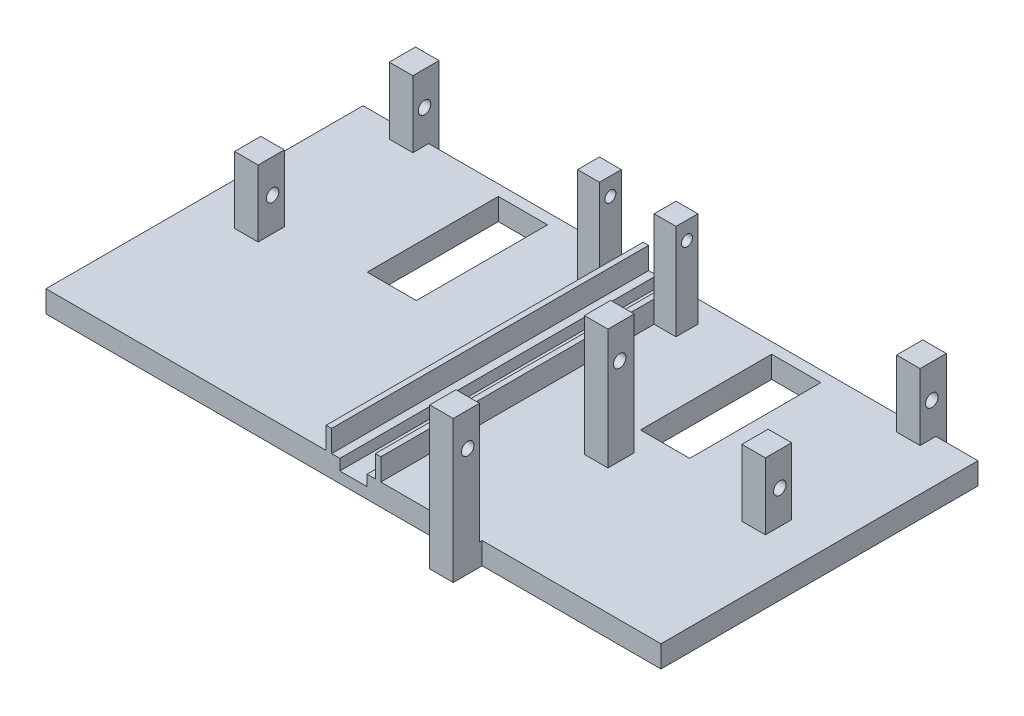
ISO-10303-21;
HEADER;
FILE_DESCRIPTION(('STEP AP214'),'2;1');
FILE_NAME('part.step','',(''),(''),'','','');
FILE_SCHEMA(('AUTOMOTIVE_DESIGN { 1 0 10303 214 1 1 1 1 }'));
ENDSEC;
DATA;
#1=APPLICATION_CONTEXT('core data for automotive mechanical design processes');
#2=APPLICATION_PROTOCOL_DEFINITION('international standard','automotive_design',2000,#1);
#3=PRODUCT_CONTEXT('',#1,'mechanical');
#4=PRODUCT('Part','Part','',(#3));
#5=PRODUCT_RELATED_PRODUCT_CATEGORY('part','',(#4));
#6=PRODUCT_DEFINITION_FORMATION('','',#4);
#7=PRODUCT_DEFINITION_CONTEXT('part definition',#1,'design');
#8=PRODUCT_DEFINITION('design','',#6,#7);
#9=PRODUCT_DEFINITION_SHAPE('','',#8);
#10=(LENGTH_UNIT() NAMED_UNIT(*) SI_UNIT(.MILLI.,.METRE.));
#11=(NAMED_UNIT(*) PLANE_ANGLE_UNIT() SI_UNIT($,.RADIAN.));
#12=(NAMED_UNIT(*) SI_UNIT($,.STERADIAN.) SOLID_ANGLE_UNIT());
#13=UNCERTAINTY_MEASURE_WITH_UNIT(LENGTH_MEASURE(1.E-05),#10,'distance_accuracy_value','');
#14=(GEOMETRIC_REPRESENTATION_CONTEXT(3) GLOBAL_UNCERTAINTY_ASSIGNED_CONTEXT((#13)) GLOBAL_UNIT_ASSIGNED_CONTEXT((#10,
#11,#12)) REPRESENTATION_CONTEXT('',''));
#15=CARTESIAN_POINT('',(0.,0.,0.));
#16=DIRECTION('',(0.,0.,1.));
#17=DIRECTION('',(1.,0.,0.));
#18=AXIS2_PLACEMENT_3D('',#15,#16,#17);
#19=CARTESIAN_POINT('',(0.,4.,0.));
#20=DIRECTION('',(0.,1.,0.));
#21=DIRECTION('',(0.,0.,1.));
#22=AXIS2_PLACEMENT_3D('',#19,#20,#21);
#23=PLANE('',#22);
#24=DIRECTION('',(-1.,0.,0.));
#25=VECTOR('',#24,1.);
#26=CARTESIAN_POINT('',(85.75,4.,2.));
#27=LINE('',#26,#25);
#28=CARTESIAN_POINT('',(85.75,4.,2.));
#29=VERTEX_POINT('',#28);
#30=CARTESIAN_POINT('',(76.75,4.,2.));
#31=VERTEX_POINT('',#30);
#32=EDGE_CURVE('E837',#29,#31,#27,.T.);
#33=ORIENTED_EDGE('',*,*,#32,.F.);
#34=DIRECTION('',(0.,0.,-1.));
#35=VECTOR('',#34,1.);
#36=CARTESIAN_POINT('',(85.75,4.,15.));
#37=LINE('',#36,#35);
#38=CARTESIAN_POINT('',(85.75,4.,26.));
#39=VERTEX_POINT('',#38);
#40=EDGE_CURVE('E1204',#39,#29,#37,.T.);
#41=ORIENTED_EDGE('',*,*,#40,.F.);
#42=DIRECTION('',(1.,0.,0.));
#43=VECTOR('',#42,1.);
#44=CARTESIAN_POINT('',(76.75,4.,26.));
#45=LINE('',#44,#43);
#46=CARTESIAN_POINT('',(76.75,4.,26.));
#47=VERTEX_POINT('',#46);
#48=EDGE_CURVE('E1218',#47,#39,#45,.T.);
#49=ORIENTED_EDGE('',*,*,#48,.F.);
#50=DIRECTION('',(0.,0.,1.));
#51=VECTOR('',#50,1.);
#52=CARTESIAN_POINT('',(76.75,4.,15.));
#53=LINE('',#52,#51);
#54=EDGE_CURVE('E1209',#31,#47,#53,.T.);
#55=ORIENTED_EDGE('',*,*,#54,.F.);
#56=EDGE_LOOP('',(#33,#41,#49,#55));
#57=FACE_BOUND('',#56,.T.);
#58=DIRECTION('',(0.,0.,1.));
#59=VECTOR('',#58,1.);
#60=CARTESIAN_POINT('',(104.8,4.,26.4));
#61=LINE('',#60,#59);
#62=CARTESIAN_POINT('',(104.8,4.,26.4));
#63=VERTEX_POINT('',#62);
#64=CARTESIAN_POINT('',(104.8,4.,31.2));
#65=VERTEX_POINT('',#64);
#66=EDGE_CURVE('E863',#63,#65,#61,.T.);
#67=ORIENTED_EDGE('',*,*,#66,.T.);
#68=DIRECTION('',(-1.,0.,0.));
#69=VECTOR('',#68,1.);
#70=CARTESIAN_POINT('',(104.8,4.,31.2));
#71=LINE('',#70,#69);
#72=CARTESIAN_POINT('',(100.5,4.,31.2));
#73=VERTEX_POINT('',#72);
#74=EDGE_CURVE('E869',#65,#73,#71,.T.);
#75=ORIENTED_EDGE('',*,*,#74,.T.);
#76=DIRECTION('',(0.,0.,-1.));
#77=VECTOR('',#76,1.);
#78=CARTESIAN_POINT('',(100.5,4.,26.4));
#79=LINE('',#78,#77);
#80=CARTESIAN_POINT('',(100.5,4.,26.4));
#81=VERTEX_POINT('',#80);
#82=EDGE_CURVE('E887',#73,#81,#79,.T.);
#83=ORIENTED_EDGE('',*,*,#82,.T.);
#84=DIRECTION('',(1.,0.,0.));
#85=VECTOR('',#84,1.);
#86=CARTESIAN_POINT('',(104.8,4.,26.4));
#87=LINE('',#86,#85);
#88=EDGE_CURVE('E884',#81,#63,#87,.T.);
#89=ORIENTED_EDGE('',*,*,#88,.T.);
#90=EDGE_LOOP('',(#67,#75,#83,#89));
#91=FACE_BOUND('',#90,.T.);
#92=DIRECTION('',(1.,0.,0.));
#93=VECTOR('',#92,1.);
#94=CARTESIAN_POINT('',(75.5,4.,35.));
#95=LINE('',#94,#93);
#96=CARTESIAN_POINT('',(75.5,4.,35.));
#97=VERTEX_POINT('',#96);
#98=CARTESIAN_POINT('',(79.8,4.,35.));
#99=VERTEX_POINT('',#98);
#100=EDGE_CURVE('E734',#97,#99,#95,.T.);
#101=ORIENTED_EDGE('',*,*,#100,.F.);
#102=DIRECTION('',(0.,0.,1.));
#103=VECTOR('',#102,1.);
#104=CARTESIAN_POINT('',(75.5,4.,30.2));
#105=LINE('',#104,#103);
#106=CARTESIAN_POINT('',(75.5,4.,30.2));
#107=VERTEX_POINT('',#106);
#108=EDGE_CURVE('E737',#107,#97,#105,.T.);
#109=ORIENTED_EDGE('',*,*,#108,.F.);
#110=DIRECTION('',(-1.,0.,0.));
#111=VECTOR('',#110,1.);
#112=CARTESIAN_POINT('',(75.5,4.,30.2));
#113=LINE('',#112,#111);
#114=CARTESIAN_POINT('',(79.8,4.,30.2));
#115=VERTEX_POINT('',#114);
#116=EDGE_CURVE('E726',#115,#107,#113,.T.);
#117=ORIENTED_EDGE('',*,*,#116,.F.);
#118=DIRECTION('',(0.,0.,-1.));
#119=VECTOR('',#118,1.);
#120=CARTESIAN_POINT('',(79.8,4.,30.2));
#121=LINE('',#120,#119);
#122=EDGE_CURVE('E729',#99,#115,#121,.T.);
#123=ORIENTED_EDGE('',*,*,#122,.F.);
#124=EDGE_LOOP('',(#101,#109,#117,#123));
#125=FACE_BOUND('',#124,.T.);
#126=DIRECTION('',(0.,0.,-1.));
#127=VECTOR('',#126,1.);
#128=CARTESIAN_POINT('',(65.25,4.,4.00000000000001));
#129=LINE('',#128,#127);
#130=CARTESIAN_POINT('',(65.25,4.,8.00000000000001));
#131=VERTEX_POINT('',#130);
#132=CARTESIAN_POINT('',(65.25,4.,4.00000000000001));
#133=VERTEX_POINT('',#132);
#134=EDGE_CURVE('E69',#131,#133,#129,.T.);
#135=ORIENTED_EDGE('',*,*,#134,.F.);
#136=DIRECTION('',(1.,0.,0.));
#137=VECTOR('',#136,1.);
#138=CARTESIAN_POINT('',(61.25,4.,8.00000000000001));
#139=LINE('',#138,#137);
#140=CARTESIAN_POINT('',(61.25,4.,8.00000000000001));
#141=VERTEX_POINT('',#140);
#142=EDGE_CURVE('E556',#141,#131,#139,.T.);
#143=ORIENTED_EDGE('',*,*,#142,.F.);
#144=DIRECTION('',(0.,0.,1.));
#145=VECTOR('',#144,1.);
#146=CARTESIAN_POINT('',(61.25,4.,0.));
#147=LINE('',#146,#145);
#148=CARTESIAN_POINT('',(61.25,4.,58.));
#149=VERTEX_POINT('',#148);
#150=EDGE_CURVE('E654',#141,#149,#147,.T.);
#151=ORIENTED_EDGE('',*,*,#150,.T.);
#152=DIRECTION('',(-1.,0.,0.));
#153=VECTOR('',#152,1.);
#154=CARTESIAN_POINT('',(0.,4.,58.));
#155=LINE('',#154,#153);
#156=CARTESIAN_POINT('',(75.5,4.,58.));
#157=VERTEX_POINT('',#156);
#158=EDGE_CURVE('E826',#157,#149,#155,.T.);
#159=ORIENTED_EDGE('',*,*,#158,.F.);
#160=DIRECTION('',(0.,0.,-1.));
#161=VECTOR('',#160,1.);
#162=CARTESIAN_POINT('',(75.5,4.,63.3));
#163=LINE('',#162,#161);
#164=CARTESIAN_POINT('',(75.5,4.,58.5));
#165=VERTEX_POINT('',#164);
#166=EDGE_CURVE('E788',#165,#157,#163,.T.);
#167=ORIENTED_EDGE('',*,*,#166,.F.);
#168=DIRECTION('',(-1.,0.,0.));
#169=VECTOR('',#168,1.);
#170=CARTESIAN_POINT('',(75.5,4.,58.5));
#171=LINE('',#170,#169);
#172=CARTESIAN_POINT('',(79.8,4.,58.5));
#173=VERTEX_POINT('',#172);
#174=EDGE_CURVE('E741',#173,#165,#171,.T.);
#175=ORIENTED_EDGE('',*,*,#174,.F.);
#176=DIRECTION('',(0.,0.,-1.));
#177=VECTOR('',#176,1.);
#178=CARTESIAN_POINT('',(79.8,4.,63.3));
#179=LINE('',#178,#177);
#180=CARTESIAN_POINT('',(79.8,4.,58.));
#181=VERTEX_POINT('',#180);
#182=EDGE_CURVE('E797',#173,#181,#179,.T.);
#183=ORIENTED_EDGE('',*,*,#182,.T.);
#184=CARTESIAN_POINT('',(112.5,4.,58.));
#185=VERTEX_POINT('',#184);
#186=EDGE_CURVE('E821',#185,#181,#155,.T.);
#187=ORIENTED_EDGE('',*,*,#186,.F.);
#188=DIRECTION('',(0.,0.,-1.));
#189=VECTOR('',#188,1.);
#190=CARTESIAN_POINT('',(112.5,4.,0.));
#191=LINE('',#190,#189);
#192=CARTESIAN_POINT('',(112.5,4.,0.));
#193=VERTEX_POINT('',#192);
#194=EDGE_CURVE('E1227',#185,#193,#191,.T.);
#195=ORIENTED_EDGE('',*,*,#194,.T.);
#196=DIRECTION('',(-1.,0.,0.));
#197=VECTOR('',#196,1.);
#198=CARTESIAN_POINT('',(0.,4.,0.));
#199=LINE('',#198,#197);
#200=CARTESIAN_POINT('',(104.8,4.,0.));
#201=VERTEX_POINT('',#200);
#202=EDGE_CURVE('E1232',#193,#201,#199,.T.);
#203=ORIENTED_EDGE('',*,*,#202,.T.);
#204=DIRECTION('',(0.,0.,1.));
#205=VECTOR('',#204,1.);
#206=CARTESIAN_POINT('',(104.8,4.,-1.9));
#207=LINE('',#206,#205);
#208=CARTESIAN_POINT('',(104.8,4.,2.9));
#209=VERTEX_POINT('',#208);
#210=EDGE_CURVE('E930',#201,#209,#207,.T.);
#211=ORIENTED_EDGE('',*,*,#210,.T.);
#212=DIRECTION('',(-1.,0.,0.));
#213=VECTOR('',#212,1.);
#214=CARTESIAN_POINT('',(104.8,4.,2.9));
#215=LINE('',#214,#213);
#216=CARTESIAN_POINT('',(100.5,4.,2.9));
#217=VERTEX_POINT('',#216);
#218=EDGE_CURVE('E917',#209,#217,#215,.T.);
#219=ORIENTED_EDGE('',*,*,#218,.T.);
#220=DIRECTION('',(0.,0.,-1.));
#221=VECTOR('',#220,1.);
#222=CARTESIAN_POINT('',(100.5,4.,-1.9));
#223=LINE('',#222,#221);
#224=CARTESIAN_POINT('',(100.5,4.,0.));
#225=VERTEX_POINT('',#224);
#226=EDGE_CURVE('E933',#217,#225,#223,.T.);
#227=ORIENTED_EDGE('',*,*,#226,.T.);
#228=CARTESIAN_POINT('',(61.25,4.,0.));
#229=VERTEX_POINT('',#228);
#230=EDGE_CURVE('E1237',#225,#229,#199,.T.);
#231=ORIENTED_EDGE('',*,*,#230,.T.);
#232=CARTESIAN_POINT('',(61.25,4.,4.00000000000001));
#233=VERTEX_POINT('',#232);
#234=EDGE_CURVE('E673',#229,#233,#147,.T.);
#235=ORIENTED_EDGE('',*,*,#234,.T.);
#236=DIRECTION('',(-1.,0.,0.));
#237=VECTOR('',#236,1.);
#238=CARTESIAN_POINT('',(61.25,4.,4.00000000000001));
#239=LINE('',#238,#237);
#240=EDGE_CURVE('E74',#133,#233,#239,.T.);
#241=ORIENTED_EDGE('',*,*,#240,.F.);
#242=EDGE_LOOP('',(#135,#143,#151,#159,#167,#175,#183,#187,#195,#203,#211,#219,#227,#231,#235,#241));
#243=FACE_BOUND('',#242,.T.);
#244=ADVANCED_FACE('F51',(#57,#91,#125,#243),#23,.T.);
#245=CARTESIAN_POINT('',(61.25,8.,0.));
#246=DIRECTION('',(1.,0.,0.));
#247=DIRECTION('',(0.,0.,-1.));
#248=AXIS2_PLACEMENT_3D('',#245,#246,#247);
#249=PLANE('',#248);
#250=ORIENTED_EDGE('',*,*,#150,.F.);
#251=DIRECTION('',(0.,-1.,0.));
#252=VECTOR('',#251,1.);
#253=CARTESIAN_POINT('',(61.25,21.5,8.00000000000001));
#254=LINE('',#253,#252);
#255=CARTESIAN_POINT('',(61.25,8.,8.00000000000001));
#256=VERTEX_POINT('',#255);
#257=EDGE_CURVE('E1442',#256,#141,#254,.T.);
#258=ORIENTED_EDGE('',*,*,#257,.F.);
#259=DIRECTION('',(0.,0.,1.));
#260=VECTOR('',#259,1.);
#261=CARTESIAN_POINT('',(61.25,8.,0.));
#262=LINE('',#261,#260);
#263=CARTESIAN_POINT('',(61.25,8.,58.));
#264=VERTEX_POINT('',#263);
#265=EDGE_CURVE('E661',#256,#264,#262,.T.);
#266=ORIENTED_EDGE('',*,*,#265,.T.);
#267=DIRECTION('',(0.,-1.,0.));
#268=VECTOR('',#267,1.);
#269=CARTESIAN_POINT('',(61.25,8.,58.));
#270=LINE('',#269,#268);
#271=EDGE_CURVE('E672',#264,#149,#270,.T.);
#272=ORIENTED_EDGE('',*,*,#271,.T.);
#273=EDGE_LOOP('',(#250,#258,#266,#272));
#274=FACE_BOUND('',#273,.T.);
#275=ADVANCED_FACE('F1375',(#274),#249,.T.);
#276=CARTESIAN_POINT('',(61.25,8.,0.));
#277=VERTEX_POINT('',#276);
#278=CARTESIAN_POINT('',(61.25,8.,4.00000000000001));
#279=VERTEX_POINT('',#278);
#280=EDGE_CURVE('E655',#277,#279,#262,.T.);
#281=ORIENTED_EDGE('',*,*,#280,.T.);
#282=DIRECTION('',(0.,-1.,0.));
#283=VECTOR('',#282,1.);
#284=CARTESIAN_POINT('',(61.25,21.5,4.00000000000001));
#285=LINE('',#284,#283);
#286=EDGE_CURVE('E519',#279,#233,#285,.T.);
#287=ORIENTED_EDGE('',*,*,#286,.T.);
#288=ORIENTED_EDGE('',*,*,#234,.F.);
#289=DIRECTION('',(0.,-1.,0.));
#290=VECTOR('',#289,1.);
#291=CARTESIAN_POINT('',(61.25,8.,0.));
#292=LINE('',#291,#290);
#293=EDGE_CURVE('E691',#277,#229,#292,.T.);
#294=ORIENTED_EDGE('',*,*,#293,.F.);
#295=EDGE_LOOP('',(#281,#287,#288,#294));
#296=FACE_BOUND('',#295,.T.);
#297=ADVANCED_FACE('F1382',(#296),#249,.T.);
#298=DIRECTION('',(1.,0.,0.));
#299=VECTOR('',#298,1.);
#300=CARTESIAN_POINT('',(7.7,4.,31.2));
#301=LINE('',#300,#299);
#302=CARTESIAN_POINT('',(7.7,4.,31.2));
#303=VERTEX_POINT('',#302);
#304=CARTESIAN_POINT('',(12.,4.,31.2));
#305=VERTEX_POINT('',#304);
#306=EDGE_CURVE('E998',#303,#305,#301,.T.);
#307=ORIENTED_EDGE('',*,*,#306,.F.);
#308=DIRECTION('',(0.,0.,1.));
#309=VECTOR('',#308,1.);
#310=CARTESIAN_POINT('',(7.7,4.,26.4));
#311=LINE('',#310,#309);
#312=CARTESIAN_POINT('',(7.7,4.,26.4));
#313=VERTEX_POINT('',#312);
#314=EDGE_CURVE('E979',#313,#303,#311,.T.);
#315=ORIENTED_EDGE('',*,*,#314,.F.);
#316=DIRECTION('',(-1.,0.,0.));
#317=VECTOR('',#316,1.);
#318=CARTESIAN_POINT('',(7.7,4.,26.4));
#319=LINE('',#318,#317);
#320=CARTESIAN_POINT('',(12.,4.,26.4));
#321=VERTEX_POINT('',#320);
#322=EDGE_CURVE('E985',#321,#313,#319,.T.);
#323=ORIENTED_EDGE('',*,*,#322,.F.);
#324=DIRECTION('',(0.,0.,-1.));
#325=VECTOR('',#324,1.);
#326=CARTESIAN_POINT('',(12.,4.,26.4));
#327=LINE('',#326,#325);
#328=EDGE_CURVE('E1001',#305,#321,#327,.T.);
#329=ORIENTED_EDGE('',*,*,#328,.F.);
#330=EDGE_LOOP('',(#307,#315,#323,#329));
#331=FACE_BOUND('',#330,.T.);
#332=DIRECTION('',(0.,0.,1.));
#333=VECTOR('',#332,1.);
#334=CARTESIAN_POINT('',(26.75,4.,15.));
#335=LINE('',#334,#333);
#336=CARTESIAN_POINT('',(26.75,4.,2.));
#337=VERTEX_POINT('',#336);
#338=CARTESIAN_POINT('',(26.75,4.,26.));
#339=VERTEX_POINT('',#338);
#340=EDGE_CURVE('E1169',#337,#339,#335,.T.);
#341=ORIENTED_EDGE('',*,*,#340,.F.);
#342=DIRECTION('',(-1.,0.,0.));
#343=VECTOR('',#342,1.);
#344=CARTESIAN_POINT('',(26.75,4.,2.));
#345=LINE('',#344,#343);
#346=CARTESIAN_POINT('',(35.75,4.,2.));
#347=VERTEX_POINT('',#346);
#348=EDGE_CURVE('E833',#347,#337,#345,.T.);
#349=ORIENTED_EDGE('',*,*,#348,.F.);
#350=DIRECTION('',(0.,0.,-1.));
#351=VECTOR('',#350,1.);
#352=CARTESIAN_POINT('',(35.75,4.,15.));
#353=LINE('',#352,#351);
#354=CARTESIAN_POINT('',(35.75,4.,26.));
#355=VERTEX_POINT('',#354);
#356=EDGE_CURVE('E1176',#355,#347,#353,.T.);
#357=ORIENTED_EDGE('',*,*,#356,.F.);
#358=DIRECTION('',(1.,0.,0.));
#359=VECTOR('',#358,1.);
#360=CARTESIAN_POINT('',(26.75,4.,26.));
#361=LINE('',#360,#359);
#362=EDGE_CURVE('E1172',#339,#355,#361,.T.);
#363=ORIENTED_EDGE('',*,*,#362,.F.);
#364=EDGE_LOOP('',(#341,#349,#357,#363));
#365=FACE_BOUND('',#364,.T.);
#366=DIRECTION('',(0.,0.,1.));
#367=VECTOR('',#366,1.);
#368=CARTESIAN_POINT('',(51.25,4.,0.));
#369=LINE('',#368,#367);
#370=CARTESIAN_POINT('',(51.25,4.,8.00000000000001));
#371=VERTEX_POINT('',#370);
#372=CARTESIAN_POINT('',(51.25,4.,58.));
#373=VERTEX_POINT('',#372);
#374=EDGE_CURVE('E635',#371,#373,#369,.T.);
#375=ORIENTED_EDGE('',*,*,#374,.F.);
#376=DIRECTION('',(1.,0.,0.));
#377=VECTOR('',#376,1.);
#378=CARTESIAN_POINT('',(47.25,4.,8.00000000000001));
#379=LINE('',#378,#377);
#380=CARTESIAN_POINT('',(47.25,4.,8.00000000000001));
#381=VERTEX_POINT('',#380);
#382=EDGE_CURVE('E555',#381,#371,#379,.T.);
#383=ORIENTED_EDGE('',*,*,#382,.F.);
#384=DIRECTION('',(0.,0.,1.));
#385=VECTOR('',#384,1.);
#386=CARTESIAN_POINT('',(47.25,4.,4.00000000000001));
#387=LINE('',#386,#385);
#388=CARTESIAN_POINT('',(47.25,4.,4.00000000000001));
#389=VERTEX_POINT('',#388);
#390=EDGE_CURVE('E551',#389,#381,#387,.T.);
#391=ORIENTED_EDGE('',*,*,#390,.F.);
#392=DIRECTION('',(-1.,0.,0.));
#393=VECTOR('',#392,1.);
#394=CARTESIAN_POINT('',(47.25,4.,4.00000000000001));
#395=LINE('',#394,#393);
#396=CARTESIAN_POINT('',(51.25,4.,4.00000000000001));
#397=VERTEX_POINT('',#396);
#398=EDGE_CURVE('E541',#397,#389,#395,.T.);
#399=ORIENTED_EDGE('',*,*,#398,.F.);
#400=CARTESIAN_POINT('',(51.25,4.,0.));
#401=VERTEX_POINT('',#400);
#402=EDGE_CURVE('E618',#401,#397,#369,.T.);
#403=ORIENTED_EDGE('',*,*,#402,.F.);
#404=CARTESIAN_POINT('',(12.,4.,0.));
#405=VERTEX_POINT('',#404);
#406=EDGE_CURVE('E1288',#401,#405,#199,.T.);
#407=ORIENTED_EDGE('',*,*,#406,.T.);
#408=DIRECTION('',(0.,0.,-1.));
#409=VECTOR('',#408,1.);
#410=CARTESIAN_POINT('',(12.,4.,-1.9));
#411=LINE('',#410,#409);
#412=CARTESIAN_POINT('',(12.,4.,2.9));
#413=VERTEX_POINT('',#412);
#414=EDGE_CURVE('E1030',#413,#405,#411,.T.);
#415=ORIENTED_EDGE('',*,*,#414,.F.);
#416=DIRECTION('',(1.,0.,0.));
#417=VECTOR('',#416,1.);
#418=CARTESIAN_POINT('',(7.7,4.,2.9));
#419=LINE('',#418,#417);
#420=CARTESIAN_POINT('',(7.7,4.,2.9));
#421=VERTEX_POINT('',#420);
#422=EDGE_CURVE('E1042',#421,#413,#419,.T.);
#423=ORIENTED_EDGE('',*,*,#422,.F.);
#424=DIRECTION('',(0.,0.,1.));
#425=VECTOR('',#424,1.);
#426=CARTESIAN_POINT('',(7.7,4.,-1.9));
#427=LINE('',#426,#425);
#428=CARTESIAN_POINT('',(7.7,4.,0.));
#429=VERTEX_POINT('',#428);
#430=EDGE_CURVE('E13',#429,#421,#427,.T.);
#431=ORIENTED_EDGE('',*,*,#430,.F.);
#432=CARTESIAN_POINT('',(0.,4.,0.));
#433=VERTEX_POINT('',#432);
#434=EDGE_CURVE('E1231',#429,#433,#199,.T.);
#435=ORIENTED_EDGE('',*,*,#434,.T.);
#436=DIRECTION('',(0.,0.,1.));
#437=VECTOR('',#436,1.);
#438=CARTESIAN_POINT('',(0.,4.,0.));
#439=LINE('',#438,#437);
#440=CARTESIAN_POINT('',(0.,4.,58.));
#441=VERTEX_POINT('',#440);
#442=EDGE_CURVE('E1223',#433,#441,#439,.T.);
#443=ORIENTED_EDGE('',*,*,#442,.T.);
#444=EDGE_CURVE('E820',#373,#441,#155,.T.);
#445=ORIENTED_EDGE('',*,*,#444,.F.);
#446=EDGE_LOOP('',(#375,#383,#391,#399,#403,#407,#415,#423,#431,#435,#443,#445));
#447=FACE_BOUND('',#446,.T.);
#448=ADVANCED_FACE('F1321',(#331,#365,#447),#23,.T.);
#449=CARTESIAN_POINT('',(51.25,8.,0.));
#450=DIRECTION('',(1.,0.,0.));
#451=DIRECTION('',(0.,0.,-1.));
#452=AXIS2_PLACEMENT_3D('',#449,#450,#451);
#453=PLANE('',#452);
#454=DIRECTION('',(0.,-1.,0.));
#455=VECTOR('',#454,1.);
#456=CARTESIAN_POINT('',(51.25,21.5,8.00000000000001));
#457=LINE('',#456,#455);
#458=CARTESIAN_POINT('',(51.25,8.,8.00000000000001));
#459=VERTEX_POINT('',#458);
#460=EDGE_CURVE('E569',#459,#371,#457,.T.);
#461=ORIENTED_EDGE('',*,*,#460,.T.);
#462=ORIENTED_EDGE('',*,*,#374,.T.);
#463=DIRECTION('',(0.,-1.,0.));
#464=VECTOR('',#463,1.);
#465=CARTESIAN_POINT('',(51.25,8.,58.));
#466=LINE('',#465,#464);
#467=CARTESIAN_POINT('',(51.25,8.,58.));
#468=VERTEX_POINT('',#467);
#469=EDGE_CURVE('E642',#468,#373,#466,.T.);
#470=ORIENTED_EDGE('',*,*,#469,.F.);
#471=DIRECTION('',(0.,0.,1.));
#472=VECTOR('',#471,1.);
#473=CARTESIAN_POINT('',(51.25,8.,0.));
#474=LINE('',#473,#472);
#475=EDGE_CURVE('E622',#459,#468,#474,.T.);
#476=ORIENTED_EDGE('',*,*,#475,.F.);
#477=EDGE_LOOP('',(#461,#462,#470,#476));
#478=FACE_BOUND('',#477,.T.);
#479=ADVANCED_FACE('F1389',(#478),#453,.F.);
#480=DIRECTION('',(0.,-1.,0.));
#481=VECTOR('',#480,1.);
#482=CARTESIAN_POINT('',(51.25,21.5,4.00000000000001));
#483=LINE('',#482,#481);
#484=CARTESIAN_POINT('',(51.25,8.,4.00000000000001));
#485=VERTEX_POINT('',#484);
#486=EDGE_CURVE('E564',#485,#397,#483,.T.);
#487=ORIENTED_EDGE('',*,*,#486,.F.);
#488=CARTESIAN_POINT('',(51.25,8.,0.));
#489=VERTEX_POINT('',#488);
#490=EDGE_CURVE('E623',#489,#485,#474,.T.);
#491=ORIENTED_EDGE('',*,*,#490,.F.);
#492=DIRECTION('',(0.,-1.,0.));
#493=VECTOR('',#492,1.);
#494=CARTESIAN_POINT('',(51.25,8.,0.));
#495=LINE('',#494,#493);
#496=EDGE_CURVE('E646',#489,#401,#495,.T.);
#497=ORIENTED_EDGE('',*,*,#496,.T.);
#498=ORIENTED_EDGE('',*,*,#402,.T.);
#499=EDGE_LOOP('',(#487,#491,#497,#498));
#500=FACE_BOUND('',#499,.T.);
#501=ADVANCED_FACE('F1399',(#500),#453,.F.);
#502=CARTESIAN_POINT('',(60.25,4.,0.));
#503=VERTEX_POINT('',#502);
#504=CARTESIAN_POINT('',(58.75,4.,0.));
#505=VERTEX_POINT('',#504);
#506=EDGE_CURVE('E1285',#503,#505,#199,.T.);
#507=ORIENTED_EDGE('',*,*,#506,.T.);
#508=DIRECTION('',(0.,0.,1.));
#509=VECTOR('',#508,1.);
#510=CARTESIAN_POINT('',(58.75,4.,0.));
#511=LINE('',#510,#509);
#512=CARTESIAN_POINT('',(58.75,4.,58.));
#513=VERTEX_POINT('',#512);
#514=EDGE_CURVE('E576',#505,#513,#511,.T.);
#515=ORIENTED_EDGE('',*,*,#514,.T.);
#516=CARTESIAN_POINT('',(60.25,4.,58.));
#517=VERTEX_POINT('',#516);
#518=EDGE_CURVE('E1312',#517,#513,#155,.T.);
#519=ORIENTED_EDGE('',*,*,#518,.F.);
#520=DIRECTION('',(0.,0.,1.));
#521=VECTOR('',#520,1.);
#522=CARTESIAN_POINT('',(60.25,4.,0.));
#523=LINE('',#522,#521);
#524=EDGE_CURVE('E676',#503,#517,#523,.T.);
#525=ORIENTED_EDGE('',*,*,#524,.F.);
#526=EDGE_LOOP('',(#507,#515,#519,#525));
#527=FACE_BOUND('',#526,.T.);
#528=ADVANCED_FACE('F1391',(#527),#23,.T.);
#529=DIRECTION('',(0.,0.,1.));
#530=VECTOR('',#529,1.);
#531=CARTESIAN_POINT('',(53.75,4.,0.));
#532=LINE('',#531,#530);
#533=CARTESIAN_POINT('',(53.75,4.,0.));
#534=VERTEX_POINT('',#533);
#535=CARTESIAN_POINT('',(53.75,4.,58.));
#536=VERTEX_POINT('',#535);
#537=EDGE_CURVE('E582',#534,#536,#532,.T.);
#538=ORIENTED_EDGE('',*,*,#537,.F.);
#539=CARTESIAN_POINT('',(52.25,4.,0.));
#540=VERTEX_POINT('',#539);
#541=EDGE_CURVE('E1238',#534,#540,#199,.T.);
#542=ORIENTED_EDGE('',*,*,#541,.T.);
#543=DIRECTION('',(0.,0.,1.));
#544=VECTOR('',#543,1.);
#545=CARTESIAN_POINT('',(52.25,4.,0.));
#546=LINE('',#545,#544);
#547=CARTESIAN_POINT('',(52.25,4.,58.));
#548=VERTEX_POINT('',#547);
#549=EDGE_CURVE('E603',#540,#548,#546,.T.);
#550=ORIENTED_EDGE('',*,*,#549,.T.);
#551=EDGE_CURVE('E827',#536,#548,#155,.T.);
#552=ORIENTED_EDGE('',*,*,#551,.F.);
#553=EDGE_LOOP('',(#538,#542,#550,#552));
#554=FACE_BOUND('',#553,.T.);
#555=ADVANCED_FACE('F1298',(#554),#23,.T.);
#556=CARTESIAN_POINT('',(0.,0.,58.));
#557=DIRECTION('',(0.,0.,-1.));
#558=DIRECTION('',(-1.,0.,0.));
#559=AXIS2_PLACEMENT_3D('',#556,#557,#558);
#560=PLANE('',#559);
#561=DIRECTION('',(1.,0.,0.));
#562=VECTOR('',#561,1.);
#563=CARTESIAN_POINT('',(53.75,2.,58.));
#564=LINE('',#563,#562);
#565=CARTESIAN_POINT('',(53.75,2.,58.));
#566=VERTEX_POINT('',#565);
#567=CARTESIAN_POINT('',(58.75,2.,58.));
#568=VERTEX_POINT('',#567);
#569=EDGE_CURVE('E577',#566,#568,#564,.T.);
#570=ORIENTED_EDGE('',*,*,#569,.F.);
#571=DIRECTION('',(0.,1.,0.));
#572=VECTOR('',#571,1.);
#573=CARTESIAN_POINT('',(53.75,2.,58.));
#574=LINE('',#573,#572);
#575=EDGE_CURVE('E599',#566,#536,#574,.T.);
#576=ORIENTED_EDGE('',*,*,#575,.T.);
#577=ORIENTED_EDGE('',*,*,#551,.T.);
#578=DIRECTION('',(0.,-1.,0.));
#579=VECTOR('',#578,1.);
#580=CARTESIAN_POINT('',(52.25,8.,58.));
#581=LINE('',#580,#579);
#582=CARTESIAN_POINT('',(52.25,8.,58.));
#583=VERTEX_POINT('',#582);
#584=EDGE_CURVE('E631',#583,#548,#581,.T.);
#585=ORIENTED_EDGE('',*,*,#584,.F.);
#586=DIRECTION('',(1.,0.,0.));
#587=VECTOR('',#586,1.);
#588=CARTESIAN_POINT('',(0.,8.,58.));
#589=LINE('',#588,#587);
#590=EDGE_CURVE('E627',#468,#583,#589,.T.);
#591=ORIENTED_EDGE('',*,*,#590,.F.);
#592=ORIENTED_EDGE('',*,*,#469,.T.);
#593=ORIENTED_EDGE('',*,*,#444,.T.);
#594=DIRECTION('',(0.,-1.,0.));
#595=VECTOR('',#594,1.);
#596=CARTESIAN_POINT('',(0.,0.,58.));
#597=LINE('',#596,#595);
#598=CARTESIAN_POINT('',(0.,0.,58.));
#599=VERTEX_POINT('',#598);
#600=EDGE_CURVE('E808',#441,#599,#597,.T.);
#601=ORIENTED_EDGE('',*,*,#600,.T.);
#602=DIRECTION('',(1.,0.,0.));
#603=VECTOR('',#602,1.);
#604=CARTESIAN_POINT('',(0.,0.,58.));
#605=LINE('',#604,#603);
#606=CARTESIAN_POINT('',(75.5,0.,58.));
#607=VERTEX_POINT('',#606);
#608=EDGE_CURVE('E813',#599,#607,#605,.T.);
#609=ORIENTED_EDGE('',*,*,#608,.T.);
#610=DIRECTION('',(0.,-1.,0.));
#611=VECTOR('',#610,1.);
#612=CARTESIAN_POINT('',(75.5,4.,58.));
#613=LINE('',#612,#611);
#614=EDGE_CURVE('E776',#157,#607,#613,.T.);
#615=ORIENTED_EDGE('',*,*,#614,.F.);
#616=ORIENTED_EDGE('',*,*,#158,.T.);
#617=ORIENTED_EDGE('',*,*,#271,.F.);
#618=DIRECTION('',(1.,0.,0.));
#619=VECTOR('',#618,1.);
#620=CARTESIAN_POINT('',(0.,8.,58.));
#621=LINE('',#620,#619);
#622=CARTESIAN_POINT('',(60.25,8.,58.));
#623=VERTEX_POINT('',#622);
#624=EDGE_CURVE('E668',#623,#264,#621,.T.);
#625=ORIENTED_EDGE('',*,*,#624,.F.);
#626=DIRECTION('',(0.,-1.,0.));
#627=VECTOR('',#626,1.);
#628=CARTESIAN_POINT('',(60.25,8.,58.));
#629=LINE('',#628,#627);
#630=EDGE_CURVE('E683',#623,#517,#629,.T.);
#631=ORIENTED_EDGE('',*,*,#630,.T.);
#632=ORIENTED_EDGE('',*,*,#518,.T.);
#633=DIRECTION('',(0.,1.,0.));
#634=VECTOR('',#633,1.);
#635=CARTESIAN_POINT('',(58.75,2.,58.));
#636=LINE('',#635,#634);
#637=EDGE_CURVE('E593',#568,#513,#636,.T.);
#638=ORIENTED_EDGE('',*,*,#637,.F.);
#639=EDGE_LOOP('',(#570,#576,#577,#585,#591,#592,#593,#601,#609,#615,#616,#617,#625,#631,#632,#638));
#640=FACE_BOUND('',#639,.T.);
#641=ADVANCED_FACE('F1310',(#640),#560,.F.);
#642=DIRECTION('',(0.,1.,0.));
#643=VECTOR('',#642,1.);
#644=CARTESIAN_POINT('',(79.8,4.,58.));
#645=LINE('',#644,#643);
#646=CARTESIAN_POINT('',(79.8,0.,58.));
#647=VERTEX_POINT('',#646);
#648=EDGE_CURVE('E782',#647,#181,#645,.T.);
#649=ORIENTED_EDGE('',*,*,#648,.F.);
#650=CARTESIAN_POINT('',(112.5,0.,58.));
#651=VERTEX_POINT('',#650);
#652=EDGE_CURVE('E812',#647,#651,#605,.T.);
#653=ORIENTED_EDGE('',*,*,#652,.T.);
#654=DIRECTION('',(0.,1.,0.));
#655=VECTOR('',#654,1.);
#656=CARTESIAN_POINT('',(112.5,0.,58.));
#657=LINE('',#656,#655);
#658=EDGE_CURVE('E816',#651,#185,#657,.T.);
#659=ORIENTED_EDGE('',*,*,#658,.T.);
#660=ORIENTED_EDGE('',*,*,#186,.T.);
#661=EDGE_LOOP('',(#649,#653,#659,#660));
#662=FACE_BOUND('',#661,.T.);
#663=ADVANCED_FACE('F1397',(#662),#560,.F.);
#664=CARTESIAN_POINT('',(0.,4.,0.));
#665=DIRECTION('',(0.,0.,1.));
#666=DIRECTION('',(1.,0.,0.));
#667=AXIS2_PLACEMENT_3D('',#664,#665,#666);
#668=PLANE('',#667);
#669=ORIENTED_EDGE('',*,*,#541,.F.);
#670=DIRECTION('',(0.,1.,0.));
#671=VECTOR('',#670,1.);
#672=CARTESIAN_POINT('',(53.75,2.,0.));
#673=LINE('',#672,#671);
#674=CARTESIAN_POINT('',(53.75,2.,0.));
#675=VERTEX_POINT('',#674);
#676=EDGE_CURVE('E604',#675,#534,#673,.T.);
#677=ORIENTED_EDGE('',*,*,#676,.F.);
#678=DIRECTION('',(1.,0.,0.));
#679=VECTOR('',#678,1.);
#680=CARTESIAN_POINT('',(53.75,2.,0.));
#681=LINE('',#680,#679);
#682=CARTESIAN_POINT('',(58.75,2.,0.));
#683=VERTEX_POINT('',#682);
#684=EDGE_CURVE('E585',#675,#683,#681,.T.);
#685=ORIENTED_EDGE('',*,*,#684,.T.);
#686=DIRECTION('',(0.,1.,0.));
#687=VECTOR('',#686,1.);
#688=CARTESIAN_POINT('',(58.75,2.,0.));
#689=LINE('',#688,#687);
#690=EDGE_CURVE('E607',#683,#505,#689,.T.);
#691=ORIENTED_EDGE('',*,*,#690,.T.);
#692=ORIENTED_EDGE('',*,*,#506,.F.);
#693=DIRECTION('',(0.,-1.,0.));
#694=VECTOR('',#693,1.);
#695=CARTESIAN_POINT('',(60.25,8.,0.));
#696=LINE('',#695,#694);
#697=CARTESIAN_POINT('',(60.25,8.,0.));
#698=VERTEX_POINT('',#697);
#699=EDGE_CURVE('E687',#698,#503,#696,.T.);
#700=ORIENTED_EDGE('',*,*,#699,.F.);
#701=DIRECTION('',(1.,0.,0.));
#702=VECTOR('',#701,1.);
#703=CARTESIAN_POINT('',(0.,8.,0.));
#704=LINE('',#703,#702);
#705=EDGE_CURVE('E659',#698,#277,#704,.T.);
#706=ORIENTED_EDGE('',*,*,#705,.T.);
#707=ORIENTED_EDGE('',*,*,#293,.T.);
#708=ORIENTED_EDGE('',*,*,#230,.F.);
#709=DIRECTION('',(0.,-1.,0.));
#710=VECTOR('',#709,1.);
#711=CARTESIAN_POINT('',(100.5,4.,0.));
#712=LINE('',#711,#710);
#713=CARTESIAN_POINT('',(100.5,0.,0.));
#714=VERTEX_POINT('',#713);
#715=EDGE_CURVE('E945',#225,#714,#712,.T.);
#716=ORIENTED_EDGE('',*,*,#715,.T.);
#717=DIRECTION('',(-1.,0.,0.));
#718=VECTOR('',#717,1.);
#719=CARTESIAN_POINT('',(0.,0.,0.));
#720=LINE('',#719,#718);
#721=CARTESIAN_POINT('',(12.,0.,0.));
#722=VERTEX_POINT('',#721);
#723=EDGE_CURVE('E1247',#714,#722,#720,.T.);
#724=ORIENTED_EDGE('',*,*,#723,.T.);
#725=DIRECTION('',(0.,-1.,0.));
#726=VECTOR('',#725,1.);
#727=CARTESIAN_POINT('',(12.,4.,0.));
#728=LINE('',#727,#726);
#729=EDGE_CURVE('E1056',#405,#722,#728,.T.);
#730=ORIENTED_EDGE('',*,*,#729,.F.);
#731=ORIENTED_EDGE('',*,*,#406,.F.);
#732=ORIENTED_EDGE('',*,*,#496,.F.);
#733=DIRECTION('',(1.,0.,0.));
#734=VECTOR('',#733,1.);
#735=CARTESIAN_POINT('',(0.,8.,0.));
#736=LINE('',#735,#734);
#737=CARTESIAN_POINT('',(52.25,8.,0.));
#738=VERTEX_POINT('',#737);
#739=EDGE_CURVE('E617',#489,#738,#736,.T.);
#740=ORIENTED_EDGE('',*,*,#739,.T.);
#741=DIRECTION('',(0.,-1.,0.));
#742=VECTOR('',#741,1.);
#743=CARTESIAN_POINT('',(52.25,8.,0.));
#744=LINE('',#743,#742);
#745=EDGE_CURVE('E650',#738,#540,#744,.T.);
#746=ORIENTED_EDGE('',*,*,#745,.T.);
#747=EDGE_LOOP('',(#669,#677,#685,#691,#692,#700,#706,#707,#708,#716,#724,#730,#731,#732,#740,#746));
#748=FACE_BOUND('',#747,.T.);
#749=ADVANCED_FACE('F1281',(#748),#668,.F.);
#750=CARTESIAN_POINT('',(112.5,0.,0.));
#751=VERTEX_POINT('',#750);
#752=CARTESIAN_POINT('',(104.8,0.,0.));
#753=VERTEX_POINT('',#752);
#754=EDGE_CURVE('E1228',#751,#753,#720,.T.);
#755=ORIENTED_EDGE('',*,*,#754,.T.);
#756=DIRECTION('',(0.,1.,0.));
#757=VECTOR('',#756,1.);
#758=CARTESIAN_POINT('',(104.8,4.,0.));
#759=LINE('',#758,#757);
#760=EDGE_CURVE('E951',#753,#201,#759,.T.);
#761=ORIENTED_EDGE('',*,*,#760,.T.);
#762=ORIENTED_EDGE('',*,*,#202,.F.);
#763=DIRECTION('',(0.,-1.,0.));
#764=VECTOR('',#763,1.);
#765=CARTESIAN_POINT('',(112.5,4.,0.));
#766=LINE('',#765,#764);
#767=EDGE_CURVE('E61',#193,#751,#766,.T.);
#768=ORIENTED_EDGE('',*,*,#767,.T.);
#769=EDGE_LOOP('',(#755,#761,#762,#768));
#770=FACE_BOUND('',#769,.T.);
#771=ADVANCED_FACE('F2162',(#770),#668,.F.);
#772=DIRECTION('',(0.,1.,0.));
#773=VECTOR('',#772,1.);
#774=CARTESIAN_POINT('',(7.7,4.,0.));
#775=LINE('',#774,#773);
#776=CARTESIAN_POINT('',(7.7,0.,0.));
#777=VERTEX_POINT('',#776);
#778=EDGE_CURVE('E1062',#777,#429,#775,.T.);
#779=ORIENTED_EDGE('',*,*,#778,.F.);
#780=CARTESIAN_POINT('',(0.,0.,0.));
#781=VERTEX_POINT('',#780);
#782=EDGE_CURVE('E1244',#777,#781,#720,.T.);
#783=ORIENTED_EDGE('',*,*,#782,.T.);
#784=DIRECTION('',(0.,-1.,0.));
#785=VECTOR('',#784,1.);
#786=CARTESIAN_POINT('',(0.,4.,0.));
#787=LINE('',#786,#785);
#788=EDGE_CURVE('E1236',#433,#781,#787,.T.);
#789=ORIENTED_EDGE('',*,*,#788,.F.);
#790=ORIENTED_EDGE('',*,*,#434,.F.);
#791=EDGE_LOOP('',(#779,#783,#789,#790));
#792=FACE_BOUND('',#791,.T.);
#793=ADVANCED_FACE('F1653',(#792),#668,.F.);
#794=CARTESIAN_POINT('',(0.,0.,0.));
#795=DIRECTION('',(0.,1.,0.));
#796=DIRECTION('',(0.,0.,1.));
#797=AXIS2_PLACEMENT_3D('',#794,#795,#796);
#798=PLANE('',#797);
#799=DIRECTION('',(0.,0.,-1.));
#800=VECTOR('',#799,1.);
#801=CARTESIAN_POINT('',(85.75,0.,15.));
#802=LINE('',#801,#800);
#803=CARTESIAN_POINT('',(85.75,0.,26.));
#804=VERTEX_POINT('',#803);
#805=CARTESIAN_POINT('',(85.75,0.,2.));
#806=VERTEX_POINT('',#805);
#807=EDGE_CURVE('E1205',#804,#806,#802,.T.);
#808=ORIENTED_EDGE('',*,*,#807,.T.);
#809=DIRECTION('',(-1.,0.,0.));
#810=VECTOR('',#809,1.);
#811=CARTESIAN_POINT('',(85.75,0.,2.));
#812=LINE('',#811,#810);
#813=CARTESIAN_POINT('',(76.75,0.,2.));
#814=VERTEX_POINT('',#813);
#815=EDGE_CURVE('E849',#806,#814,#812,.T.);
#816=ORIENTED_EDGE('',*,*,#815,.T.);
#817=DIRECTION('',(0.,0.,1.));
#818=VECTOR('',#817,1.);
#819=CARTESIAN_POINT('',(76.75,0.,15.));
#820=LINE('',#819,#818);
#821=CARTESIAN_POINT('',(76.75,0.,26.));
#822=VERTEX_POINT('',#821);
#823=EDGE_CURVE('E1185',#814,#822,#820,.T.);
#824=ORIENTED_EDGE('',*,*,#823,.T.);
#825=DIRECTION('',(1.,0.,0.));
#826=VECTOR('',#825,1.);
#827=CARTESIAN_POINT('',(76.75,0.,26.));
#828=LINE('',#827,#826);
#829=EDGE_CURVE('E1208',#822,#804,#828,.T.);
#830=ORIENTED_EDGE('',*,*,#829,.T.);
#831=EDGE_LOOP('',(#808,#816,#824,#830));
#832=FACE_BOUND('',#831,.T.);
#833=DIRECTION('',(-1.,0.,0.));
#834=VECTOR('',#833,1.);
#835=CARTESIAN_POINT('',(43.5818606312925,0.,31.4600708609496));
#836=LINE('',#835,#834);
#837=CARTESIAN_POINT('',(36.25,0.,31.4600708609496));
#838=VERTEX_POINT('',#837);
#839=CARTESIAN_POINT('',(26.25,0.,31.4600708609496));
#840=VERTEX_POINT('',#839);
#841=EDGE_CURVE('E1114',#838,#840,#836,.T.);
#842=ORIENTED_EDGE('',*,*,#841,.T.);
#843=DIRECTION('',(0.,0.,-1.));
#844=VECTOR('',#843,1.);
#845=CARTESIAN_POINT('',(26.25,0.,37.4391961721));
#846=LINE('',#845,#844);
#847=CARTESIAN_POINT('',(26.25,0.,37.4391961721));
#848=VERTEX_POINT('',#847);
#849=EDGE_CURVE('E1104',#848,#840,#846,.T.);
#850=ORIENTED_EDGE('',*,*,#849,.F.);
#851=DIRECTION('',(-1.,0.,0.));
#852=VECTOR('',#851,1.);
#853=CARTESIAN_POINT('',(43.5818606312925,0.,37.4391961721));
#854=LINE('',#853,#852);
#855=CARTESIAN_POINT('',(36.25,0.,37.4391961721));
#856=VERTEX_POINT('',#855);
#857=EDGE_CURVE('E1118',#856,#848,#854,.T.);
#858=ORIENTED_EDGE('',*,*,#857,.F.);
#859=DIRECTION('',(0.,0.,1.));
#860=VECTOR('',#859,1.);
#861=CARTESIAN_POINT('',(36.25,0.,37.4391961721));
#862=LINE('',#861,#860);
#863=EDGE_CURVE('E1083',#838,#856,#862,.T.);
#864=ORIENTED_EDGE('',*,*,#863,.F.);
#865=EDGE_LOOP('',(#842,#850,#858,#864));
#866=FACE_BOUND('',#865,.T.);
#867=DIRECTION('',(-1.,0.,0.));
#868=VECTOR('',#867,1.);
#869=CARTESIAN_POINT('',(93.5818606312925,0.,31.4600708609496));
#870=LINE('',#869,#868);
#871=CARTESIAN_POINT('',(86.25,0.,31.4600708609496));
#872=VERTEX_POINT('',#871);
#873=CARTESIAN_POINT('',(76.25,0.,31.4600708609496));
#874=VERTEX_POINT('',#873);
#875=EDGE_CURVE('E1157',#872,#874,#870,.T.);
#876=ORIENTED_EDGE('',*,*,#875,.T.);
#877=DIRECTION('',(0.,0.,-1.));
#878=VECTOR('',#877,1.);
#879=CARTESIAN_POINT('',(76.25,0.,37.4391961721));
#880=LINE('',#879,#878);
#881=CARTESIAN_POINT('',(76.25,0.,37.4391961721));
#882=VERTEX_POINT('',#881);
#883=EDGE_CURVE('E1147',#882,#874,#880,.T.);
#884=ORIENTED_EDGE('',*,*,#883,.F.);
#885=DIRECTION('',(-1.,0.,0.));
#886=VECTOR('',#885,1.);
#887=CARTESIAN_POINT('',(93.5818606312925,0.,37.4391961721));
#888=LINE('',#887,#886);
#889=CARTESIAN_POINT('',(86.25,0.,37.4391961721));
#890=VERTEX_POINT('',#889);
#891=EDGE_CURVE('E1161',#890,#882,#888,.T.);
#892=ORIENTED_EDGE('',*,*,#891,.F.);
#893=DIRECTION('',(0.,0.,1.));
#894=VECTOR('',#893,1.);
#895=CARTESIAN_POINT('',(86.25,0.,37.4391961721));
#896=LINE('',#895,#894);
#897=EDGE_CURVE('E1126',#872,#890,#896,.T.);
#898=ORIENTED_EDGE('',*,*,#897,.F.);
#899=EDGE_LOOP('',(#876,#884,#892,#898));
#900=FACE_BOUND('',#899,.T.);
#901=DIRECTION('',(0.,0.,1.));
#902=VECTOR('',#901,1.);
#903=CARTESIAN_POINT('',(0.,0.,0.));
#904=LINE('',#903,#902);
#905=EDGE_CURVE('E1197',#781,#599,#904,.T.);
#906=ORIENTED_EDGE('',*,*,#905,.F.);
#907=ORIENTED_EDGE('',*,*,#782,.F.);
#908=DIRECTION('',(0.,0.,1.));
#909=VECTOR('',#908,1.);
#910=CARTESIAN_POINT('',(7.7,0.,-1.9));
#911=LINE('',#910,#909);
#912=CARTESIAN_POINT('',(7.7,0.,-1.9));
#913=VERTEX_POINT('',#912);
#914=EDGE_CURVE('E1068',#913,#777,#911,.T.);
#915=ORIENTED_EDGE('',*,*,#914,.F.);
#916=DIRECTION('',(-1.,0.,0.));
#917=VECTOR('',#916,1.);
#918=CARTESIAN_POINT('',(12.,0.,-1.9));
#919=LINE('',#918,#917);
#920=CARTESIAN_POINT('',(12.,0.,-1.9));
#921=VERTEX_POINT('',#920);
#922=EDGE_CURVE('E1061',#921,#913,#919,.T.);
#923=ORIENTED_EDGE('',*,*,#922,.F.);
#924=DIRECTION('',(0.,0.,1.));
#925=VECTOR('',#924,1.);
#926=CARTESIAN_POINT('',(12.,0.,-1.9));
#927=LINE('',#926,#925);
#928=EDGE_CURVE('E1078',#921,#722,#927,.T.);
#929=ORIENTED_EDGE('',*,*,#928,.T.);
#930=ORIENTED_EDGE('',*,*,#723,.F.);
#931=DIRECTION('',(0.,0.,1.));
#932=VECTOR('',#931,1.);
#933=CARTESIAN_POINT('',(100.5,0.,-1.9));
#934=LINE('',#933,#932);
#935=CARTESIAN_POINT('',(100.5,0.,-1.9));
#936=VERTEX_POINT('',#935);
#937=EDGE_CURVE('E958',#936,#714,#934,.T.);
#938=ORIENTED_EDGE('',*,*,#937,.F.);
#939=DIRECTION('',(1.,0.,0.));
#940=VECTOR('',#939,1.);
#941=CARTESIAN_POINT('',(100.5,0.,-1.9));
#942=LINE('',#941,#940);
#943=CARTESIAN_POINT('',(104.8,0.,-1.9));
#944=VERTEX_POINT('',#943);
#945=EDGE_CURVE('E954',#936,#944,#942,.T.);
#946=ORIENTED_EDGE('',*,*,#945,.T.);
#947=DIRECTION('',(0.,0.,1.));
#948=VECTOR('',#947,1.);
#949=CARTESIAN_POINT('',(104.8,0.,-1.9));
#950=LINE('',#949,#948);
#951=EDGE_CURVE('E967',#944,#753,#950,.T.);
#952=ORIENTED_EDGE('',*,*,#951,.T.);
#953=ORIENTED_EDGE('',*,*,#754,.F.);
#954=DIRECTION('',(0.,0.,-1.));
#955=VECTOR('',#954,1.);
#956=CARTESIAN_POINT('',(112.5,0.,0.));
#957=LINE('',#956,#955);
#958=EDGE_CURVE('E1241',#651,#751,#957,.T.);
#959=ORIENTED_EDGE('',*,*,#958,.F.);
#960=ORIENTED_EDGE('',*,*,#652,.F.);
#961=DIRECTION('',(0.,0.,-1.));
#962=VECTOR('',#961,1.);
#963=CARTESIAN_POINT('',(79.8,0.,63.3));
#964=LINE('',#963,#962);
#965=CARTESIAN_POINT('',(79.8,0.,63.3));
#966=VERTEX_POINT('',#965);
#967=EDGE_CURVE('E800',#966,#647,#964,.T.);
#968=ORIENTED_EDGE('',*,*,#967,.F.);
#969=DIRECTION('',(1.,0.,0.));
#970=VECTOR('',#969,1.);
#971=CARTESIAN_POINT('',(75.5,0.,63.3));
#972=LINE('',#971,#970);
#973=CARTESIAN_POINT('',(75.5,0.,63.3));
#974=VERTEX_POINT('',#973);
#975=EDGE_CURVE('E781',#974,#966,#972,.T.);
#976=ORIENTED_EDGE('',*,*,#975,.F.);
#977=DIRECTION('',(0.,0.,-1.));
#978=VECTOR('',#977,1.);
#979=CARTESIAN_POINT('',(75.5,0.,63.3));
#980=LINE('',#979,#978);
#981=EDGE_CURVE('E804',#974,#607,#980,.T.);
#982=ORIENTED_EDGE('',*,*,#981,.T.);
#983=ORIENTED_EDGE('',*,*,#608,.F.);
#984=EDGE_LOOP('',(#906,#907,#915,#923,#929,#930,#938,#946,#952,#953,#959,#960,#968,#976,#982,#983));
#985=FACE_BOUND('',#984,.T.);
#986=DIRECTION('',(-1.,0.,0.));
#987=VECTOR('',#986,1.);
#988=CARTESIAN_POINT('',(26.75,0.,2.));
#989=LINE('',#988,#987);
#990=CARTESIAN_POINT('',(35.75,0.,2.));
#991=VERTEX_POINT('',#990);
#992=CARTESIAN_POINT('',(26.75,0.,2.));
#993=VERTEX_POINT('',#992);
#994=EDGE_CURVE('E828',#991,#993,#989,.T.);
#995=ORIENTED_EDGE('',*,*,#994,.T.);
#996=DIRECTION('',(0.,0.,1.));
#997=VECTOR('',#996,1.);
#998=CARTESIAN_POINT('',(26.75,0.,15.));
#999=LINE('',#998,#997);
#1000=CARTESIAN_POINT('',(26.75,0.,26.));
#1001=VERTEX_POINT('',#1000);
#1002=EDGE_CURVE('E1180',#993,#1001,#999,.T.);
#1003=ORIENTED_EDGE('',*,*,#1002,.T.);
#1004=DIRECTION('',(1.,0.,0.));
#1005=VECTOR('',#1004,1.);
#1006=CARTESIAN_POINT('',(26.75,0.,26.));
#1007=LINE('',#1006,#1005);
#1008=CARTESIAN_POINT('',(35.75,0.,26.));
#1009=VERTEX_POINT('',#1008);
#1010=EDGE_CURVE('E1184',#1001,#1009,#1007,.T.);
#1011=ORIENTED_EDGE('',*,*,#1010,.T.);
#1012=DIRECTION('',(0.,0.,-1.));
#1013=VECTOR('',#1012,1.);
#1014=CARTESIAN_POINT('',(35.75,0.,15.));
#1015=LINE('',#1014,#1013);
#1016=EDGE_CURVE('E1173',#1009,#991,#1015,.T.);
#1017=ORIENTED_EDGE('',*,*,#1016,.T.);
#1018=EDGE_LOOP('',(#995,#1003,#1011,#1017));
#1019=FACE_BOUND('',#1018,.T.);
#1020=ADVANCED_FACE('F1327',(#832,#866,#900,#985,#1019),#798,.F.);
#1021=CARTESIAN_POINT('',(0.,4.,0.));
#1022=DIRECTION('',(1.,0.,0.));
#1023=DIRECTION('',(0.,0.,-1.));
#1024=AXIS2_PLACEMENT_3D('',#1021,#1022,#1023);
#1025=PLANE('',#1024);
#1026=ORIENTED_EDGE('',*,*,#905,.T.);
#1027=ORIENTED_EDGE('',*,*,#600,.F.);
#1028=ORIENTED_EDGE('',*,*,#442,.F.);
#1029=ORIENTED_EDGE('',*,*,#788,.T.);
#1030=EDGE_LOOP('',(#1026,#1027,#1028,#1029));
#1031=FACE_BOUND('',#1030,.T.);
#1032=ADVANCED_FACE('F53',(#1031),#1025,.F.);
#1033=CARTESIAN_POINT('',(112.5,4.,0.));
#1034=DIRECTION('',(-1.,0.,0.));
#1035=DIRECTION('',(0.,0.,1.));
#1036=AXIS2_PLACEMENT_3D('',#1033,#1034,#1035);
#1037=PLANE('',#1036);
#1038=ORIENTED_EDGE('',*,*,#958,.T.);
#1039=ORIENTED_EDGE('',*,*,#767,.F.);
#1040=ORIENTED_EDGE('',*,*,#194,.F.);
#1041=ORIENTED_EDGE('',*,*,#658,.F.);
#1042=EDGE_LOOP('',(#1038,#1039,#1040,#1041));
#1043=FACE_BOUND('',#1042,.T.);
#1044=ADVANCED_FACE('F1586',(#1043),#1037,.F.);
#1045=CARTESIAN_POINT('',(76.75,4.,15.));
#1046=DIRECTION('',(1.,0.,0.));
#1047=DIRECTION('',(0.,0.,-1.));
#1048=AXIS2_PLACEMENT_3D('',#1045,#1046,#1047);
#1049=PLANE('',#1048);
#1050=ORIENTED_EDGE('',*,*,#823,.F.);
#1051=DIRECTION('',(0.,1.,0.));
#1052=VECTOR('',#1051,1.);
#1053=CARTESIAN_POINT('',(76.75,0.,2.));
#1054=LINE('',#1053,#1052);
#1055=EDGE_CURVE('E825',#814,#31,#1054,.T.);
#1056=ORIENTED_EDGE('',*,*,#1055,.T.);
#1057=ORIENTED_EDGE('',*,*,#54,.T.);
#1058=DIRECTION('',(0.,-1.,0.));
#1059=VECTOR('',#1058,1.);
#1060=CARTESIAN_POINT('',(76.75,4.,26.));
#1061=LINE('',#1060,#1059);
#1062=EDGE_CURVE('E1139',#47,#822,#1061,.T.);
#1063=ORIENTED_EDGE('',*,*,#1062,.T.);
#1064=EDGE_LOOP('',(#1050,#1056,#1057,#1063));
#1065=FACE_BOUND('',#1064,.T.);
#1066=ADVANCED_FACE('F1582',(#1065),#1049,.T.);
#1067=CARTESIAN_POINT('',(76.75,4.,26.));
#1068=DIRECTION('',(0.,0.,-1.));
#1069=DIRECTION('',(-1.,0.,0.));
#1070=AXIS2_PLACEMENT_3D('',#1067,#1068,#1069);
#1071=PLANE('',#1070);
#1072=ORIENTED_EDGE('',*,*,#829,.F.);
#1073=ORIENTED_EDGE('',*,*,#1062,.F.);
#1074=ORIENTED_EDGE('',*,*,#48,.T.);
#1075=DIRECTION('',(0.,-1.,0.));
#1076=VECTOR('',#1075,1.);
#1077=CARTESIAN_POINT('',(85.75,4.,26.));
#1078=LINE('',#1077,#1076);
#1079=EDGE_CURVE('E1201',#39,#804,#1078,.T.);
#1080=ORIENTED_EDGE('',*,*,#1079,.T.);
#1081=EDGE_LOOP('',(#1072,#1073,#1074,#1080));
#1082=FACE_BOUND('',#1081,.T.);
#1083=ADVANCED_FACE('F1585',(#1082),#1071,.T.);
#1084=CARTESIAN_POINT('',(85.75,4.,15.));
#1085=DIRECTION('',(-1.,0.,0.));
#1086=DIRECTION('',(0.,0.,1.));
#1087=AXIS2_PLACEMENT_3D('',#1084,#1085,#1086);
#1088=PLANE('',#1087);
#1089=ORIENTED_EDGE('',*,*,#807,.F.);
#1090=ORIENTED_EDGE('',*,*,#1079,.F.);
#1091=ORIENTED_EDGE('',*,*,#40,.T.);
#1092=DIRECTION('',(0.,1.,0.));
#1093=VECTOR('',#1092,1.);
#1094=CARTESIAN_POINT('',(85.75,0.,2.));
#1095=LINE('',#1094,#1093);
#1096=EDGE_CURVE('E845',#806,#29,#1095,.T.);
#1097=ORIENTED_EDGE('',*,*,#1096,.F.);
#1098=EDGE_LOOP('',(#1089,#1090,#1091,#1097));
#1099=FACE_BOUND('',#1098,.T.);
#1100=ADVANCED_FACE('F1593',(#1099),#1088,.T.);
#1101=CARTESIAN_POINT('',(26.75,4.,15.));
#1102=DIRECTION('',(1.,0.,0.));
#1103=DIRECTION('',(0.,0.,-1.));
#1104=AXIS2_PLACEMENT_3D('',#1101,#1102,#1103);
#1105=PLANE('',#1104);
#1106=ORIENTED_EDGE('',*,*,#1002,.F.);
#1107=DIRECTION('',(0.,1.,0.));
#1108=VECTOR('',#1107,1.);
#1109=CARTESIAN_POINT('',(26.75,0.,2.));
#1110=LINE('',#1109,#1108);
#1111=EDGE_CURVE('E838',#993,#337,#1110,.T.);
#1112=ORIENTED_EDGE('',*,*,#1111,.T.);
#1113=ORIENTED_EDGE('',*,*,#340,.T.);
#1114=DIRECTION('',(0.,-1.,0.));
#1115=VECTOR('',#1114,1.);
#1116=CARTESIAN_POINT('',(26.75,4.,26.));
#1117=LINE('',#1116,#1115);
#1118=EDGE_CURVE('E1193',#339,#1001,#1117,.T.);
#1119=ORIENTED_EDGE('',*,*,#1118,.T.);
#1120=EDGE_LOOP('',(#1106,#1112,#1113,#1119));
#1121=FACE_BOUND('',#1120,.T.);
#1122=ADVANCED_FACE('F1596',(#1121),#1105,.T.);
#1123=CARTESIAN_POINT('',(26.75,4.,26.));
#1124=DIRECTION('',(0.,0.,-1.));
#1125=DIRECTION('',(-1.,0.,0.));
#1126=AXIS2_PLACEMENT_3D('',#1123,#1124,#1125);
#1127=PLANE('',#1126);
#1128=ORIENTED_EDGE('',*,*,#1010,.F.);
#1129=ORIENTED_EDGE('',*,*,#1118,.F.);
#1130=ORIENTED_EDGE('',*,*,#362,.T.);
#1131=DIRECTION('',(0.,-1.,0.));
#1132=VECTOR('',#1131,1.);
#1133=CARTESIAN_POINT('',(35.75,4.,26.));
#1134=LINE('',#1133,#1132);
#1135=EDGE_CURVE('E1179',#355,#1009,#1134,.T.);
#1136=ORIENTED_EDGE('',*,*,#1135,.T.);
#1137=EDGE_LOOP('',(#1128,#1129,#1130,#1136));
#1138=FACE_BOUND('',#1137,.T.);
#1139=ADVANCED_FACE('F1604',(#1138),#1127,.T.);
#1140=CARTESIAN_POINT('',(35.75,4.,15.));
#1141=DIRECTION('',(-1.,0.,0.));
#1142=DIRECTION('',(0.,0.,1.));
#1143=AXIS2_PLACEMENT_3D('',#1140,#1141,#1142);
#1144=PLANE('',#1143);
#1145=ORIENTED_EDGE('',*,*,#1016,.F.);
#1146=ORIENTED_EDGE('',*,*,#1135,.F.);
#1147=ORIENTED_EDGE('',*,*,#356,.T.);
#1148=DIRECTION('',(0.,1.,0.));
#1149=VECTOR('',#1148,1.);
#1150=CARTESIAN_POINT('',(35.75,0.,2.));
#1151=LINE('',#1150,#1149);
#1152=EDGE_CURVE('E832',#991,#347,#1151,.T.);
#1153=ORIENTED_EDGE('',*,*,#1152,.F.);
#1154=EDGE_LOOP('',(#1145,#1146,#1147,#1153));
#1155=FACE_BOUND('',#1154,.T.);
#1156=ADVANCED_FACE('F1611',(#1155),#1144,.T.);
#1157=CARTESIAN_POINT('',(76.25,0.,0.));
#1158=DIRECTION('',(-1.,0.,0.));
#1159=DIRECTION('',(0.,0.,1.));
#1160=AXIS2_PLACEMENT_3D('',#1157,#1158,#1159);
#1161=PLANE('',#1160);
#1162=DIRECTION('',(0.,-0.274177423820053,0.961679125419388));
#1163=VECTOR('',#1162,1.);
#1164=CARTESIAN_POINT('',(76.25,1.09014647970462,37.75));
#1165=LINE('',#1164,#1163);
#1166=CARTESIAN_POINT('',(76.25,2.66666666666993,32.2203450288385));
#1167=VERTEX_POINT('',#1166);
#1168=CARTESIAN_POINT('',(76.25,1.09014647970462,37.75));
#1169=VERTEX_POINT('',#1168);
#1170=EDGE_CURVE('E1096',#1167,#1169,#1165,.T.);
#1171=ORIENTED_EDGE('',*,*,#1170,.T.);
#1172=DIRECTION('',(0.,-0.961679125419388,-0.274177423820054));
#1173=VECTOR('',#1172,1.);
#1174=CARTESIAN_POINT('',(76.25,1.09014647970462,37.75));
#1175=LINE('',#1174,#1173);
#1176=EDGE_CURVE('E1143',#1169,#882,#1175,.T.);
#1177=ORIENTED_EDGE('',*,*,#1176,.T.);
#1178=ORIENTED_EDGE('',*,*,#883,.T.);
#1179=DIRECTION('',(0.,0.961679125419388,0.274177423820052));
#1180=VECTOR('',#1179,1.);
#1181=CARTESIAN_POINT('',(76.25,2.66666666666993,32.2203450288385));
#1182=LINE('',#1181,#1180);
#1183=EDGE_CURVE('E1150',#874,#1167,#1182,.T.);
#1184=ORIENTED_EDGE('',*,*,#1183,.T.);
#1185=EDGE_LOOP('',(#1171,#1177,#1178,#1184));
#1186=FACE_BOUND('',#1185,.T.);
#1187=ADVANCED_FACE('F1613',(#1186),#1161,.F.);
#1188=CARTESIAN_POINT('',(93.5818606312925,2.66666666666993,32.2203450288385));
#1189=DIRECTION('',(0.,-0.274177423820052,0.961679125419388));
#1190=DIRECTION('',(0.,-0.961679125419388,-0.274177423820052));
#1191=AXIS2_PLACEMENT_3D('',#1188,#1189,#1190);
#1192=PLANE('',#1191);
#1193=DIRECTION('',(-1.,0.,0.));
#1194=VECTOR('',#1193,1.);
#1195=CARTESIAN_POINT('',(93.5818606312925,2.66666666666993,32.2203450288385));
#1196=LINE('',#1195,#1194);
#1197=CARTESIAN_POINT('',(86.25,2.66666666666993,32.2203450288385));
#1198=VERTEX_POINT('',#1197);
#1199=EDGE_CURVE('E1154',#1198,#1167,#1196,.T.);
#1200=ORIENTED_EDGE('',*,*,#1199,.T.);
#1201=ORIENTED_EDGE('',*,*,#1183,.F.);
#1202=ORIENTED_EDGE('',*,*,#875,.F.);
#1203=DIRECTION('',(0.,-0.961679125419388,-0.274177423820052));
#1204=VECTOR('',#1203,1.);
#1205=CARTESIAN_POINT('',(86.25,2.66666666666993,32.2203450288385));
#1206=LINE('',#1205,#1204);
#1207=EDGE_CURVE('E1131',#1198,#872,#1206,.T.);
#1208=ORIENTED_EDGE('',*,*,#1207,.F.);
#1209=EDGE_LOOP('',(#1200,#1201,#1202,#1208));
#1210=FACE_BOUND('',#1209,.T.);
#1211=ADVANCED_FACE('F2053',(#1210),#1192,.T.);
#1212=CARTESIAN_POINT('',(93.5818606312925,1.09014647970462,37.75));
#1213=DIRECTION('',(0.,0.274177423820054,-0.961679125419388));
#1214=DIRECTION('',(0.,0.961679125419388,0.274177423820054));
#1215=AXIS2_PLACEMENT_3D('',#1212,#1213,#1214);
#1216=PLANE('',#1215);
#1217=ORIENTED_EDGE('',*,*,#891,.T.);
#1218=ORIENTED_EDGE('',*,*,#1176,.F.);
#1219=DIRECTION('',(-1.,0.,0.));
#1220=VECTOR('',#1219,1.);
#1221=CARTESIAN_POINT('',(93.5818606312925,1.09014647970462,37.75));
#1222=LINE('',#1221,#1220);
#1223=CARTESIAN_POINT('',(86.25,1.09014647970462,37.75));
#1224=VERTEX_POINT('',#1223);
#1225=EDGE_CURVE('E1164',#1224,#1169,#1222,.T.);
#1226=ORIENTED_EDGE('',*,*,#1225,.F.);
#1227=DIRECTION('',(0.,0.961679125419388,0.274177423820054));
#1228=VECTOR('',#1227,1.);
#1229=CARTESIAN_POINT('',(86.25,1.09014647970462,37.75));
#1230=LINE('',#1229,#1228);
#1231=EDGE_CURVE('E1130',#890,#1224,#1230,.T.);
#1232=ORIENTED_EDGE('',*,*,#1231,.F.);
#1233=EDGE_LOOP('',(#1217,#1218,#1226,#1232));
#1234=FACE_BOUND('',#1233,.T.);
#1235=ADVANCED_FACE('F2057',(#1234),#1216,.T.);
#1236=CARTESIAN_POINT('',(93.5818606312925,1.09014647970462,37.75));
#1237=DIRECTION('',(0.,-0.961679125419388,-0.274177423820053));
#1238=DIRECTION('',(0.,0.274177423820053,-0.961679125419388));
#1239=AXIS2_PLACEMENT_3D('',#1236,#1237,#1238);
#1240=PLANE('',#1239);
#1241=ORIENTED_EDGE('',*,*,#1225,.T.);
#1242=ORIENTED_EDGE('',*,*,#1170,.F.);
#1243=ORIENTED_EDGE('',*,*,#1199,.F.);
#1244=DIRECTION('',(0.,0.274177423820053,-0.961679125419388));
#1245=VECTOR('',#1244,1.);
#1246=CARTESIAN_POINT('',(86.25,1.09014647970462,37.75));
#1247=LINE('',#1246,#1245);
#1248=EDGE_CURVE('E1135',#1224,#1198,#1247,.T.);
#1249=ORIENTED_EDGE('',*,*,#1248,.F.);
#1250=EDGE_LOOP('',(#1241,#1242,#1243,#1249));
#1251=FACE_BOUND('',#1250,.T.);
#1252=ADVANCED_FACE('F2049',(#1251),#1240,.T.);
#1253=CARTESIAN_POINT('',(86.25,4.,15.));
#1254=DIRECTION('',(-1.,0.,0.));
#1255=DIRECTION('',(0.,0.,1.));
#1256=AXIS2_PLACEMENT_3D('',#1253,#1254,#1255);
#1257=PLANE('',#1256);
#1258=ORIENTED_EDGE('',*,*,#1231,.T.);
#1259=ORIENTED_EDGE('',*,*,#1248,.T.);
#1260=ORIENTED_EDGE('',*,*,#1207,.T.);
#1261=ORIENTED_EDGE('',*,*,#897,.T.);
#1262=EDGE_LOOP('',(#1258,#1259,#1260,#1261));
#1263=FACE_BOUND('',#1262,.T.);
#1264=ADVANCED_FACE('F2035',(#1263),#1257,.T.);
#1265=CARTESIAN_POINT('',(26.25,0.,0.));
#1266=DIRECTION('',(-1.,0.,0.));
#1267=DIRECTION('',(0.,0.,1.));
#1268=AXIS2_PLACEMENT_3D('',#1265,#1266,#1267);
#1269=PLANE('',#1268);
#1270=DIRECTION('',(0.,-0.274177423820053,0.961679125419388));
#1271=VECTOR('',#1270,1.);
#1272=CARTESIAN_POINT('',(26.25,1.09014647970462,37.75));
#1273=LINE('',#1272,#1271);
#1274=CARTESIAN_POINT('',(26.25,2.66666666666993,32.2203450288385));
#1275=VERTEX_POINT('',#1274);
#1276=CARTESIAN_POINT('',(26.25,1.09014647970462,37.75));
#1277=VERTEX_POINT('',#1276);
#1278=EDGE_CURVE('E1082',#1275,#1277,#1273,.T.);
#1279=ORIENTED_EDGE('',*,*,#1278,.T.);
#1280=DIRECTION('',(0.,-0.961679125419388,-0.274177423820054));
#1281=VECTOR('',#1280,1.);
#1282=CARTESIAN_POINT('',(26.25,1.09014647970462,37.75));
#1283=LINE('',#1282,#1281);
#1284=EDGE_CURVE('E1100',#1277,#848,#1283,.T.);
#1285=ORIENTED_EDGE('',*,*,#1284,.T.);
#1286=ORIENTED_EDGE('',*,*,#849,.T.);
#1287=DIRECTION('',(0.,0.961679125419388,0.274177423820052));
#1288=VECTOR('',#1287,1.);
#1289=CARTESIAN_POINT('',(26.25,2.66666666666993,32.2203450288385));
#1290=LINE('',#1289,#1288);
#1291=EDGE_CURVE('E1107',#840,#1275,#1290,.T.);
#1292=ORIENTED_EDGE('',*,*,#1291,.T.);
#1293=EDGE_LOOP('',(#1279,#1285,#1286,#1292));
#1294=FACE_BOUND('',#1293,.T.);
#1295=ADVANCED_FACE('F2031',(#1294),#1269,.F.);
#1296=CARTESIAN_POINT('',(43.5818606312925,2.66666666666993,32.2203450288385));
#1297=DIRECTION('',(0.,-0.274177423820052,0.961679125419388));
#1298=DIRECTION('',(0.,-0.961679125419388,-0.274177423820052));
#1299=AXIS2_PLACEMENT_3D('',#1296,#1297,#1298);
#1300=PLANE('',#1299);
#1301=DIRECTION('',(-1.,0.,0.));
#1302=VECTOR('',#1301,1.);
#1303=CARTESIAN_POINT('',(43.5818606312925,2.66666666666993,32.2203450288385));
#1304=LINE('',#1303,#1302);
#1305=CARTESIAN_POINT('',(36.25,2.66666666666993,32.2203450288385));
#1306=VERTEX_POINT('',#1305);
#1307=EDGE_CURVE('E1111',#1306,#1275,#1304,.T.);
#1308=ORIENTED_EDGE('',*,*,#1307,.T.);
#1309=ORIENTED_EDGE('',*,*,#1291,.F.);
#1310=ORIENTED_EDGE('',*,*,#841,.F.);
#1311=DIRECTION('',(0.,-0.961679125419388,-0.274177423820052));
#1312=VECTOR('',#1311,1.);
#1313=CARTESIAN_POINT('',(36.25,2.66666666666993,32.2203450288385));
#1314=LINE('',#1313,#1312);
#1315=EDGE_CURVE('E1088',#1306,#838,#1314,.T.);
#1316=ORIENTED_EDGE('',*,*,#1315,.F.);
#1317=EDGE_LOOP('',(#1308,#1309,#1310,#1316));
#1318=FACE_BOUND('',#1317,.T.);
#1319=ADVANCED_FACE('F2034',(#1318),#1300,.T.);
#1320=CARTESIAN_POINT('',(43.5818606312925,1.09014647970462,37.75));
#1321=DIRECTION('',(0.,0.274177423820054,-0.961679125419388));
#1322=DIRECTION('',(0.,0.961679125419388,0.274177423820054));
#1323=AXIS2_PLACEMENT_3D('',#1320,#1321,#1322);
#1324=PLANE('',#1323);
#1325=ORIENTED_EDGE('',*,*,#857,.T.);
#1326=ORIENTED_EDGE('',*,*,#1284,.F.);
#1327=DIRECTION('',(-1.,0.,0.));
#1328=VECTOR('',#1327,1.);
#1329=CARTESIAN_POINT('',(43.5818606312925,1.09014647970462,37.75));
#1330=LINE('',#1329,#1328);
#1331=CARTESIAN_POINT('',(36.25,1.09014647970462,37.75));
#1332=VERTEX_POINT('',#1331);
#1333=EDGE_CURVE('E1121',#1332,#1277,#1330,.T.);
#1334=ORIENTED_EDGE('',*,*,#1333,.F.);
#1335=DIRECTION('',(0.,0.961679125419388,0.274177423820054));
#1336=VECTOR('',#1335,1.);
#1337=CARTESIAN_POINT('',(36.25,1.09014647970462,37.75));
#1338=LINE('',#1337,#1336);
#1339=EDGE_CURVE('E1087',#856,#1332,#1338,.T.);
#1340=ORIENTED_EDGE('',*,*,#1339,.F.);
#1341=EDGE_LOOP('',(#1325,#1326,#1334,#1340));
#1342=FACE_BOUND('',#1341,.T.);
#1343=ADVANCED_FACE('F2039',(#1342),#1324,.T.);
#1344=CARTESIAN_POINT('',(43.5818606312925,1.09014647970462,37.75));
#1345=DIRECTION('',(0.,-0.961679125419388,-0.274177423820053));
#1346=DIRECTION('',(0.,0.274177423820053,-0.961679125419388));
#1347=AXIS2_PLACEMENT_3D('',#1344,#1345,#1346);
#1348=PLANE('',#1347);
#1349=ORIENTED_EDGE('',*,*,#1333,.T.);
#1350=ORIENTED_EDGE('',*,*,#1278,.F.);
#1351=ORIENTED_EDGE('',*,*,#1307,.F.);
#1352=DIRECTION('',(0.,0.274177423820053,-0.961679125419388));
#1353=VECTOR('',#1352,1.);
#1354=CARTESIAN_POINT('',(36.25,1.09014647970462,37.75));
#1355=LINE('',#1354,#1353);
#1356=EDGE_CURVE('E1092',#1332,#1306,#1355,.T.);
#1357=ORIENTED_EDGE('',*,*,#1356,.F.);
#1358=EDGE_LOOP('',(#1349,#1350,#1351,#1357));
#1359=FACE_BOUND('',#1358,.T.);
#1360=ADVANCED_FACE('F2029',(#1359),#1348,.T.);
#1361=CARTESIAN_POINT('',(36.25,4.,15.));
#1362=DIRECTION('',(-1.,0.,0.));
#1363=DIRECTION('',(0.,0.,1.));
#1364=AXIS2_PLACEMENT_3D('',#1361,#1362,#1363);
#1365=PLANE('',#1364);
#1366=ORIENTED_EDGE('',*,*,#1339,.T.);
#1367=ORIENTED_EDGE('',*,*,#1356,.T.);
#1368=ORIENTED_EDGE('',*,*,#1315,.T.);
#1369=ORIENTED_EDGE('',*,*,#863,.T.);
#1370=EDGE_LOOP('',(#1366,#1367,#1368,#1369));
#1371=FACE_BOUND('',#1370,.T.);
#1372=ADVANCED_FACE('F2025',(#1371),#1365,.T.);
#1373=CARTESIAN_POINT('',(12.,4.,-1.9));
#1374=DIRECTION('',(-1.,0.,0.));
#1375=DIRECTION('',(0.,-1.,0.));
#1376=AXIS2_PLACEMENT_3D('',#1373,#1374,#1375);
#1377=PLANE('',#1376);
#1378=CARTESIAN_POINT('',(12.,10.1,0.749999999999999));
#1379=DIRECTION('',(-1.,0.,0.));
#1380=DIRECTION('',(0.,-1.,0.));
#1381=AXIS2_PLACEMENT_3D('',#1378,#1379,#1380);
#1382=CIRCLE('',#1381,1.15);
#1383=CARTESIAN_POINT('',(12.,10.1,1.9));
#1384=VERTEX_POINT('',#1383);
#1385=EDGE_CURVE('E1020',#1384,#1384,#1382,.F.);
#1386=ORIENTED_EDGE('',*,*,#1385,.F.);
#1387=EDGE_LOOP('',(#1386));
#1388=FACE_BOUND('',#1387,.T.);
#1389=ORIENTED_EDGE('',*,*,#729,.T.);
#1390=ORIENTED_EDGE('',*,*,#928,.F.);
#1391=DIRECTION('',(0.,-1.,0.));
#1392=VECTOR('',#1391,1.);
#1393=CARTESIAN_POINT('',(12.,4.,-1.9));
#1394=LINE('',#1393,#1392);
#1395=CARTESIAN_POINT('',(12.,16.2,-1.9));
#1396=VERTEX_POINT('',#1395);
#1397=EDGE_CURVE('E1057',#1396,#921,#1394,.T.);
#1398=ORIENTED_EDGE('',*,*,#1397,.F.);
#1399=DIRECTION('',(0.,0.,-1.));
#1400=VECTOR('',#1399,1.);
#1401=CARTESIAN_POINT('',(12.,16.2,-1.9));
#1402=LINE('',#1401,#1400);
#1403=CARTESIAN_POINT('',(12.,16.2,2.9));
#1404=VERTEX_POINT('',#1403);
#1405=EDGE_CURVE('E1033',#1404,#1396,#1402,.T.);
#1406=ORIENTED_EDGE('',*,*,#1405,.F.);
#1407=DIRECTION('',(0.,-1.,0.));
#1408=VECTOR('',#1407,1.);
#1409=CARTESIAN_POINT('',(12.,16.2,2.9));
#1410=LINE('',#1409,#1408);
#1411=EDGE_CURVE('E1040',#1404,#413,#1410,.T.);
#1412=ORIENTED_EDGE('',*,*,#1411,.T.);
#1413=ORIENTED_EDGE('',*,*,#414,.T.);
#1414=EDGE_LOOP('',(#1389,#1390,#1398,#1406,#1412,#1413));
#1415=FACE_BOUND('',#1414,.T.);
#1416=ADVANCED_FACE('F2002',(#1388,#1415),#1377,.F.);
#1417=CARTESIAN_POINT('',(7.7,4.,-1.9));
#1418=DIRECTION('',(1.,0.,0.));
#1419=DIRECTION('',(0.,1.,0.));
#1420=AXIS2_PLACEMENT_3D('',#1417,#1418,#1419);
#1421=PLANE('',#1420);
#1422=CARTESIAN_POINT('',(7.7,10.1,0.75));
#1423=DIRECTION('',(1.,0.,0.));
#1424=DIRECTION('',(0.,1.,0.));
#1425=AXIS2_PLACEMENT_3D('',#1422,#1423,#1424);
#1426=CIRCLE('',#1425,1.15);
#1427=CARTESIAN_POINT('',(7.7,10.1,1.9));
#1428=VERTEX_POINT('',#1427);
#1429=EDGE_CURVE('E1024',#1428,#1428,#1426,.T.);
#1430=ORIENTED_EDGE('',*,*,#1429,.T.);
#1431=EDGE_LOOP('',(#1430));
#1432=FACE_BOUND('',#1431,.T.);
#1433=ORIENTED_EDGE('',*,*,#778,.T.);
#1434=ORIENTED_EDGE('',*,*,#430,.T.);
#1435=DIRECTION('',(0.,-1.,0.));
#1436=VECTOR('',#1435,1.);
#1437=CARTESIAN_POINT('',(7.7,16.2,2.9));
#1438=LINE('',#1437,#1436);
#1439=CARTESIAN_POINT('',(7.7,16.2,2.9));
#1440=VERTEX_POINT('',#1439);
#1441=EDGE_CURVE('E1052',#1440,#421,#1438,.T.);
#1442=ORIENTED_EDGE('',*,*,#1441,.F.);
#1443=DIRECTION('',(0.,0.,1.));
#1444=VECTOR('',#1443,1.);
#1445=CARTESIAN_POINT('',(7.7,16.2,-1.9));
#1446=LINE('',#1445,#1444);
#1447=CARTESIAN_POINT('',(7.7,16.2,-1.9));
#1448=VERTEX_POINT('',#1447);
#1449=EDGE_CURVE('E1025',#1448,#1440,#1446,.T.);
#1450=ORIENTED_EDGE('',*,*,#1449,.F.);
#1451=DIRECTION('',(0.,1.,0.));
#1452=VECTOR('',#1451,1.);
#1453=CARTESIAN_POINT('',(7.7,4.,-1.9));
#1454=LINE('',#1453,#1452);
#1455=EDGE_CURVE('E1065',#913,#1448,#1454,.T.);
#1456=ORIENTED_EDGE('',*,*,#1455,.F.);
#1457=ORIENTED_EDGE('',*,*,#914,.T.);
#1458=EDGE_LOOP('',(#1433,#1434,#1442,#1450,#1456,#1457));
#1459=FACE_BOUND('',#1458,.T.);
#1460=ADVANCED_FACE('F1991',(#1432,#1459),#1421,.F.);
#1461=CARTESIAN_POINT('',(0.,0.,-1.9));
#1462=DIRECTION('',(0.,0.,-1.));
#1463=DIRECTION('',(-1.,0.,0.));
#1464=AXIS2_PLACEMENT_3D('',#1461,#1462,#1463);
#1465=PLANE('',#1464);
#1466=ORIENTED_EDGE('',*,*,#1397,.T.);
#1467=ORIENTED_EDGE('',*,*,#922,.T.);
#1468=ORIENTED_EDGE('',*,*,#1455,.T.);
#1469=DIRECTION('',(-1.,0.,0.));
#1470=VECTOR('',#1469,1.);
#1471=CARTESIAN_POINT('',(7.7,16.2,-1.9));
#1472=LINE('',#1471,#1470);
#1473=EDGE_CURVE('E1037',#1396,#1448,#1472,.T.);
#1474=ORIENTED_EDGE('',*,*,#1473,.F.);
#1475=EDGE_LOOP('',(#1466,#1467,#1468,#1474));
#1476=FACE_BOUND('',#1475,.T.);
#1477=ADVANCED_FACE('F1996',(#1476),#1465,.T.);
#1478=CARTESIAN_POINT('',(7.7,16.2,2.9));
#1479=DIRECTION('',(0.,0.,-1.));
#1480=DIRECTION('',(-1.,0.,0.));
#1481=AXIS2_PLACEMENT_3D('',#1478,#1479,#1480);
#1482=PLANE('',#1481);
#1483=ORIENTED_EDGE('',*,*,#422,.T.);
#1484=ORIENTED_EDGE('',*,*,#1411,.F.);
#1485=DIRECTION('',(1.,0.,0.));
#1486=VECTOR('',#1485,1.);
#1487=CARTESIAN_POINT('',(7.7,16.2,2.9));
#1488=LINE('',#1487,#1486);
#1489=EDGE_CURVE('E1029',#1440,#1404,#1488,.T.);
#1490=ORIENTED_EDGE('',*,*,#1489,.F.);
#1491=ORIENTED_EDGE('',*,*,#1441,.T.);
#1492=EDGE_LOOP('',(#1483,#1484,#1490,#1491));
#1493=FACE_BOUND('',#1492,.T.);
#1494=ADVANCED_FACE('F2008',(#1493),#1482,.F.);
#1495=CARTESIAN_POINT('',(0.,16.2,0.));
#1496=DIRECTION('',(0.,1.,0.));
#1497=DIRECTION('',(0.,0.,1.));
#1498=AXIS2_PLACEMENT_3D('',#1495,#1496,#1497);
#1499=PLANE('',#1498);
#1500=ORIENTED_EDGE('',*,*,#1449,.T.);
#1501=ORIENTED_EDGE('',*,*,#1489,.T.);
#1502=ORIENTED_EDGE('',*,*,#1405,.T.);
#1503=ORIENTED_EDGE('',*,*,#1473,.T.);
#1504=EDGE_LOOP('',(#1500,#1501,#1502,#1503));
#1505=FACE_BOUND('',#1504,.T.);
#1506=ADVANCED_FACE('F1998',(#1505),#1499,.T.);
#1507=CARTESIAN_POINT('',(15.2526911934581,10.1,0.749999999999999));
#1508=DIRECTION('',(-1.,0.,0.));
#1509=DIRECTION('',(0.,0.,1.));
#1510=AXIS2_PLACEMENT_3D('',#1507,#1508,#1509);
#1511=CYLINDRICAL_SURFACE('',#1510,1.15);
#1512=CARTESIAN_POINT('',(12.,10.1,1.9));
#1513=CARTESIAN_POINT('',(11.9552083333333,10.1,1.9));
#1514=CARTESIAN_POINT('',(11.9104166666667,10.1,1.9));
#1515=CARTESIAN_POINT('',(11.8208333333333,10.1,1.9));
#1516=CARTESIAN_POINT('',(11.7760416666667,10.1,1.9));
#1517=CARTESIAN_POINT('',(11.6864583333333,10.1,1.9));
#1518=CARTESIAN_POINT('',(11.6416666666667,10.1,1.9));
#1519=CARTESIAN_POINT('',(11.5520833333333,10.1,1.9));
#1520=CARTESIAN_POINT('',(11.5072916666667,10.1,1.9));
#1521=CARTESIAN_POINT('',(11.4177083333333,10.1,1.9));
#1522=CARTESIAN_POINT('',(11.3729166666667,10.1,1.9));
#1523=CARTESIAN_POINT('',(11.2833333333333,10.1,1.9));
#1524=CARTESIAN_POINT('',(11.2385416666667,10.1,1.9));
#1525=CARTESIAN_POINT('',(11.1489583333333,10.1,1.9));
#1526=CARTESIAN_POINT('',(11.1041666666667,10.1,1.9));
#1527=CARTESIAN_POINT('',(11.0145833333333,10.1,1.9));
#1528=CARTESIAN_POINT('',(10.9697916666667,10.1,1.9));
#1529=CARTESIAN_POINT('',(10.8802083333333,10.1,1.9));
#1530=CARTESIAN_POINT('',(10.8354166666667,10.1,1.9));
#1531=CARTESIAN_POINT('',(10.7458333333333,10.1,1.9));
#1532=CARTESIAN_POINT('',(10.7010416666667,10.1,1.9));
#1533=CARTESIAN_POINT('',(10.6114583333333,10.1,1.9));
#1534=CARTESIAN_POINT('',(10.5666666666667,10.1,1.9));
#1535=CARTESIAN_POINT('',(10.4770833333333,10.1,1.9));
#1536=CARTESIAN_POINT('',(10.4322916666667,10.1,1.9));
#1537=CARTESIAN_POINT('',(10.3427083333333,10.1,1.9));
#1538=CARTESIAN_POINT('',(10.2979166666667,10.1,1.9));
#1539=CARTESIAN_POINT('',(10.2083333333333,10.1,1.9));
#1540=CARTESIAN_POINT('',(10.1635416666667,10.1,1.9));
#1541=CARTESIAN_POINT('',(10.0739583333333,10.1,1.9));
#1542=CARTESIAN_POINT('',(10.0291666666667,10.1,1.9));
#1543=CARTESIAN_POINT('',(9.93958333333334,10.1,1.9));
#1544=CARTESIAN_POINT('',(9.89479166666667,10.1,1.9));
#1545=CARTESIAN_POINT('',(9.80520833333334,10.1,1.9));
#1546=CARTESIAN_POINT('',(9.76041666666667,10.1,1.9));
#1547=CARTESIAN_POINT('',(9.67083333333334,10.1,1.9));
#1548=CARTESIAN_POINT('',(9.62604166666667,10.1,1.9));
#1549=CARTESIAN_POINT('',(9.53645833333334,10.1,1.9));
#1550=CARTESIAN_POINT('',(9.49166666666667,10.1,1.9));
#1551=CARTESIAN_POINT('',(9.40208333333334,10.1,1.9));
#1552=CARTESIAN_POINT('',(9.35729166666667,10.1,1.9));
#1553=CARTESIAN_POINT('',(9.26770833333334,10.1,1.9));
#1554=CARTESIAN_POINT('',(9.22291666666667,10.1,1.9));
#1555=CARTESIAN_POINT('',(9.13333333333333,10.1,1.9));
#1556=CARTESIAN_POINT('',(9.08854166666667,10.1,1.9));
#1557=CARTESIAN_POINT('',(8.99895833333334,10.1,1.9));
#1558=CARTESIAN_POINT('',(8.95416666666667,10.1,1.9));
#1559=CARTESIAN_POINT('',(8.86458333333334,10.1,1.9));
#1560=CARTESIAN_POINT('',(8.81979166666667,10.1,1.9));
#1561=CARTESIAN_POINT('',(8.73020833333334,10.1,1.9));
#1562=CARTESIAN_POINT('',(8.68541666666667,10.1,1.9));
#1563=CARTESIAN_POINT('',(8.59583333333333,10.1,1.9));
#1564=CARTESIAN_POINT('',(8.55104166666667,10.1,1.9));
#1565=CARTESIAN_POINT('',(8.46145833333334,10.1,1.9));
#1566=CARTESIAN_POINT('',(8.41666666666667,10.1,1.9));
#1567=CARTESIAN_POINT('',(8.32708333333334,10.1,1.9));
#1568=CARTESIAN_POINT('',(8.28229166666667,10.1,1.9));
#1569=CARTESIAN_POINT('',(8.19270833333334,10.1,1.9));
#1570=CARTESIAN_POINT('',(8.14791666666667,10.1,1.9));
#1571=CARTESIAN_POINT('',(8.05833333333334,10.1,1.9));
#1572=CARTESIAN_POINT('',(8.01354166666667,10.1,1.9));
#1573=CARTESIAN_POINT('',(7.92395833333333,10.1,1.9));
#1574=CARTESIAN_POINT('',(7.87916666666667,10.1,1.9));
#1575=CARTESIAN_POINT('',(7.78958333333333,10.1,1.9));
#1576=CARTESIAN_POINT('',(7.74479166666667,10.1,1.9));
#1577=CARTESIAN_POINT('',(7.7,10.1,1.9));
#1578=B_SPLINE_CURVE_WITH_KNOTS('',3,(#1512,#1513,#1514,#1515,#1516,#1517,#1518,#1519,#1520,
#1521,#1522,#1523,#1524,#1525,#1526,#1527,#1528,#1529,#1530,#1531,#1532,#1533,#1534,#1535,#1536,
#1537,#1538,#1539,#1540,#1541,#1542,#1543,#1544,#1545,#1546,#1547,#1548,#1549,#1550,#1551,#1552,
#1553,#1554,#1555,#1556,#1557,#1558,#1559,#1560,#1561,#1562,#1563,#1564,#1565,#1566,#1567,#1568,
#1569,#1570,#1571,#1572,#1573,#1574,#1575,#1576,#1577),.UNSPECIFIED.,.F.,.F.,(4,2,2,2,2,2,2,2,2,
2,2,2,2,2,2,2,2,2,2,2,2,2,2,2,2,2,2,2,2,2,2,2,4),(0.,0.134374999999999,0.26875,
0.403124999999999,0.5375,0.671874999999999,0.80625,0.940625,1.075,1.209375,1.34375,1.478125,
1.6125,1.746875,1.88125,2.015625,2.15,2.284375,2.41875,2.553125,2.6875,2.821875,2.95625,
3.090625,3.225,3.359375,3.49375,3.628125,3.7625,3.896875,4.03125,4.165625,4.3),.UNSPECIFIED.);
#1579=EDGE_CURVE('BSEAM2015',#1384,#1428,#1578,.T.);
#1580=ORIENTED_EDGE('',*,*,#1385,.T.);
#1581=ORIENTED_EDGE('',*,*,#1429,.F.);
#1582=ORIENTED_EDGE('',*,*,#1579,.T.);
#1583=ORIENTED_EDGE('',*,*,#1579,.F.);
#1584=EDGE_LOOP('',(#1580,#1582,#1581,#1583));
#1585=FACE_BOUND('',#1584,.T.);
#1586=ADVANCED_FACE('F2015',(#1585),#1511,.F.);
#1587=CARTESIAN_POINT('',(7.7,16.2,26.4));
#1588=DIRECTION('',(1.,0.,0.));
#1589=DIRECTION('',(0.,0.,-1.));
#1590=AXIS2_PLACEMENT_3D('',#1587,#1588,#1589);
#1591=PLANE('',#1590);
#1592=CARTESIAN_POINT('',(7.7,10.1,28.55));
#1593=DIRECTION('',(1.,0.,0.));
#1594=DIRECTION('',(0.,0.,-1.));
#1595=AXIS2_PLACEMENT_3D('',#1592,#1593,#1594);
#1596=CIRCLE('',#1595,1.15);
#1597=CARTESIAN_POINT('',(7.7,10.1,27.4));
#1598=VERTEX_POINT('',#1597);
#1599=EDGE_CURVE('E975',#1598,#1598,#1596,.F.);
#1600=ORIENTED_EDGE('',*,*,#1599,.F.);
#1601=EDGE_LOOP('',(#1600));
#1602=FACE_BOUND('',#1601,.T.);
#1603=ORIENTED_EDGE('',*,*,#314,.T.);
#1604=DIRECTION('',(0.,-1.,0.));
#1605=VECTOR('',#1604,1.);
#1606=CARTESIAN_POINT('',(7.7,16.2,31.2));
#1607=LINE('',#1606,#1605);
#1608=CARTESIAN_POINT('',(7.7,16.2,31.2));
#1609=VERTEX_POINT('',#1608);
#1610=EDGE_CURVE('E1017',#1609,#303,#1607,.T.);
#1611=ORIENTED_EDGE('',*,*,#1610,.F.);
#1612=DIRECTION('',(0.,0.,1.));
#1613=VECTOR('',#1612,1.);
#1614=CARTESIAN_POINT('',(7.7,16.2,26.4));
#1615=LINE('',#1614,#1613);
#1616=CARTESIAN_POINT('',(7.7,16.2,26.4));
#1617=VERTEX_POINT('',#1616);
#1618=EDGE_CURVE('E980',#1617,#1609,#1615,.T.);
#1619=ORIENTED_EDGE('',*,*,#1618,.F.);
#1620=DIRECTION('',(0.,-1.,0.));
#1621=VECTOR('',#1620,1.);
#1622=CARTESIAN_POINT('',(7.7,16.2,26.4));
#1623=LINE('',#1622,#1621);
#1624=EDGE_CURVE('E994',#1617,#313,#1623,.T.);
#1625=ORIENTED_EDGE('',*,*,#1624,.T.);
#1626=EDGE_LOOP('',(#1603,#1611,#1619,#1625));
#1627=FACE_BOUND('',#1626,.T.);
#1628=ADVANCED_FACE('F2195',(#1602,#1627),#1591,.F.);
#1629=CARTESIAN_POINT('',(7.7,16.2,31.2));
#1630=DIRECTION('',(0.,0.,-1.));
#1631=DIRECTION('',(-1.,0.,0.));
#1632=AXIS2_PLACEMENT_3D('',#1629,#1630,#1631);
#1633=PLANE('',#1632);
#1634=ORIENTED_EDGE('',*,*,#306,.T.);
#1635=DIRECTION('',(0.,-1.,0.));
#1636=VECTOR('',#1635,1.);
#1637=CARTESIAN_POINT('',(12.,16.2,31.2));
#1638=LINE('',#1637,#1636);
#1639=CARTESIAN_POINT('',(12.,16.2,31.2));
#1640=VERTEX_POINT('',#1639);
#1641=EDGE_CURVE('E1013',#1640,#305,#1638,.T.);
#1642=ORIENTED_EDGE('',*,*,#1641,.F.);
#1643=DIRECTION('',(1.,0.,0.));
#1644=VECTOR('',#1643,1.);
#1645=CARTESIAN_POINT('',(7.7,16.2,31.2));
#1646=LINE('',#1645,#1644);
#1647=EDGE_CURVE('E984',#1609,#1640,#1646,.T.);
#1648=ORIENTED_EDGE('',*,*,#1647,.F.);
#1649=ORIENTED_EDGE('',*,*,#1610,.T.);
#1650=EDGE_LOOP('',(#1634,#1642,#1648,#1649));
#1651=FACE_BOUND('',#1650,.T.);
#1652=ADVANCED_FACE('F2205',(#1651),#1633,.F.);
#1653=CARTESIAN_POINT('',(12.,16.2,26.4));
#1654=DIRECTION('',(-1.,0.,0.));
#1655=DIRECTION('',(0.,0.,1.));
#1656=AXIS2_PLACEMENT_3D('',#1653,#1654,#1655);
#1657=PLANE('',#1656);
#1658=CARTESIAN_POINT('',(12.,10.1,28.55));
#1659=DIRECTION('',(-1.,0.,0.));
#1660=DIRECTION('',(0.,-1.,0.));
#1661=AXIS2_PLACEMENT_3D('',#1658,#1659,#1660);
#1662=CIRCLE('',#1661,1.15);
#1663=CARTESIAN_POINT('',(12.,8.95,28.55));
#1664=VERTEX_POINT('',#1663);
#1665=EDGE_CURVE('E971',#1664,#1664,#1662,.T.);
#1666=ORIENTED_EDGE('',*,*,#1665,.T.);
#1667=EDGE_LOOP('',(#1666));
#1668=FACE_BOUND('',#1667,.T.);
#1669=ORIENTED_EDGE('',*,*,#328,.T.);
#1670=DIRECTION('',(0.,-1.,0.));
#1671=VECTOR('',#1670,1.);
#1672=CARTESIAN_POINT('',(12.,16.2,26.4));
#1673=LINE('',#1672,#1671);
#1674=CARTESIAN_POINT('',(12.,16.2,26.4));
#1675=VERTEX_POINT('',#1674);
#1676=EDGE_CURVE('E1010',#1675,#321,#1673,.T.);
#1677=ORIENTED_EDGE('',*,*,#1676,.F.);
#1678=DIRECTION('',(0.,0.,-1.));
#1679=VECTOR('',#1678,1.);
#1680=CARTESIAN_POINT('',(12.,16.2,26.4));
#1681=LINE('',#1680,#1679);
#1682=EDGE_CURVE('E988',#1640,#1675,#1681,.T.);
#1683=ORIENTED_EDGE('',*,*,#1682,.F.);
#1684=ORIENTED_EDGE('',*,*,#1641,.T.);
#1685=EDGE_LOOP('',(#1669,#1677,#1683,#1684));
#1686=FACE_BOUND('',#1685,.T.);
#1687=ADVANCED_FACE('F2216',(#1668,#1686),#1657,.F.);
#1688=CARTESIAN_POINT('',(7.7,16.2,26.4));
#1689=DIRECTION('',(0.,0.,1.));
#1690=DIRECTION('',(1.,0.,0.));
#1691=AXIS2_PLACEMENT_3D('',#1688,#1689,#1690);
#1692=PLANE('',#1691);
#1693=ORIENTED_EDGE('',*,*,#322,.T.);
#1694=ORIENTED_EDGE('',*,*,#1624,.F.);
#1695=DIRECTION('',(-1.,0.,0.));
#1696=VECTOR('',#1695,1.);
#1697=CARTESIAN_POINT('',(7.7,16.2,26.4));
#1698=LINE('',#1697,#1696);
#1699=EDGE_CURVE('E991',#1675,#1617,#1698,.T.);
#1700=ORIENTED_EDGE('',*,*,#1699,.F.);
#1701=ORIENTED_EDGE('',*,*,#1676,.T.);
#1702=EDGE_LOOP('',(#1693,#1694,#1700,#1701));
#1703=FACE_BOUND('',#1702,.T.);
#1704=ADVANCED_FACE('F2226',(#1703),#1692,.F.);
#1705=CARTESIAN_POINT('',(0.,16.2,0.));
#1706=DIRECTION('',(0.,1.,0.));
#1707=DIRECTION('',(0.,0.,1.));
#1708=AXIS2_PLACEMENT_3D('',#1705,#1706,#1707);
#1709=PLANE('',#1708);
#1710=ORIENTED_EDGE('',*,*,#1618,.T.);
#1711=ORIENTED_EDGE('',*,*,#1647,.T.);
#1712=ORIENTED_EDGE('',*,*,#1682,.T.);
#1713=ORIENTED_EDGE('',*,*,#1699,.T.);
#1714=EDGE_LOOP('',(#1710,#1711,#1712,#1713));
#1715=FACE_BOUND('',#1714,.T.);
#1716=ADVANCED_FACE('F2236',(#1715),#1709,.T.);
#1717=CARTESIAN_POINT('',(15.2526911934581,10.1,28.55));
#1718=DIRECTION('',(-1.,0.,0.));
#1719=DIRECTION('',(0.,0.,1.));
#1720=AXIS2_PLACEMENT_3D('',#1717,#1718,#1719);
#1721=CYLINDRICAL_SURFACE('',#1720,1.15);
#1722=ORIENTED_EDGE('',*,*,#1665,.F.);
#1723=EDGE_LOOP('',(#1722));
#1724=FACE_BOUND('',#1723,.T.);
#1725=ORIENTED_EDGE('',*,*,#1599,.T.);
#1726=EDGE_LOOP('',(#1725));
#1727=FACE_BOUND('',#1726,.T.);
#1728=ADVANCED_FACE('F1274',(#1724,#1727),#1721,.F.);
#1729=CARTESIAN_POINT('',(100.5,4.,-1.9));
#1730=DIRECTION('',(-1.,0.,0.));
#1731=DIRECTION('',(0.,-1.,0.));
#1732=AXIS2_PLACEMENT_3D('',#1729,#1730,#1731);
#1733=PLANE('',#1732);
#1734=CARTESIAN_POINT('',(100.5,10.1,0.749999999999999));
#1735=DIRECTION('',(1.,0.,0.));
#1736=DIRECTION('',(0.,1.,0.));
#1737=AXIS2_PLACEMENT_3D('',#1734,#1735,#1736);
#1738=CIRCLE('',#1737,1.15);
#1739=CARTESIAN_POINT('',(100.5,10.1,-0.400000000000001));
#1740=VERTEX_POINT('',#1739);
#1741=EDGE_CURVE('E907',#1740,#1740,#1738,.T.);
#1742=ORIENTED_EDGE('',*,*,#1741,.T.);
#1743=EDGE_LOOP('',(#1742));
#1744=FACE_BOUND('',#1743,.T.);
#1745=ORIENTED_EDGE('',*,*,#715,.F.);
#1746=ORIENTED_EDGE('',*,*,#226,.F.);
#1747=DIRECTION('',(0.,-1.,0.));
#1748=VECTOR('',#1747,1.);
#1749=CARTESIAN_POINT('',(100.5,16.2,2.9));
#1750=LINE('',#1749,#1748);
#1751=CARTESIAN_POINT('',(100.5,16.2,2.9));
#1752=VERTEX_POINT('',#1751);
#1753=EDGE_CURVE('E941',#1752,#217,#1750,.T.);
#1754=ORIENTED_EDGE('',*,*,#1753,.F.);
#1755=DIRECTION('',(0.,0.,-1.));
#1756=VECTOR('',#1755,1.);
#1757=CARTESIAN_POINT('',(100.5,16.2,-1.9));
#1758=LINE('',#1757,#1756);
#1759=CARTESIAN_POINT('',(100.5,16.2,-1.9));
#1760=VERTEX_POINT('',#1759);
#1761=EDGE_CURVE('E921',#1752,#1760,#1758,.T.);
#1762=ORIENTED_EDGE('',*,*,#1761,.T.);
#1763=DIRECTION('',(0.,-1.,0.));
#1764=VECTOR('',#1763,1.);
#1765=CARTESIAN_POINT('',(100.5,4.,-1.9));
#1766=LINE('',#1765,#1764);
#1767=EDGE_CURVE('E946',#1760,#936,#1766,.T.);
#1768=ORIENTED_EDGE('',*,*,#1767,.T.);
#1769=ORIENTED_EDGE('',*,*,#937,.T.);
#1770=EDGE_LOOP('',(#1745,#1746,#1754,#1762,#1768,#1769));
#1771=FACE_BOUND('',#1770,.T.);
#1772=ADVANCED_FACE('F1271',(#1744,#1771),#1733,.T.);
#1773=CARTESIAN_POINT('',(104.8,4.,-1.9));
#1774=DIRECTION('',(1.,0.,0.));
#1775=DIRECTION('',(0.,1.,0.));
#1776=AXIS2_PLACEMENT_3D('',#1773,#1774,#1775);
#1777=PLANE('',#1776);
#1778=CARTESIAN_POINT('',(104.8,10.1,0.75));
#1779=DIRECTION('',(1.,0.,0.));
#1780=DIRECTION('',(0.,1.,0.));
#1781=AXIS2_PLACEMENT_3D('',#1778,#1779,#1780);
#1782=CIRCLE('',#1781,1.15);
#1783=CARTESIAN_POINT('',(104.8,10.1,-0.4));
#1784=VERTEX_POINT('',#1783);
#1785=EDGE_CURVE('E911',#1784,#1784,#1782,.F.);
#1786=ORIENTED_EDGE('',*,*,#1785,.T.);
#1787=EDGE_LOOP('',(#1786));
#1788=FACE_BOUND('',#1787,.T.);
#1789=ORIENTED_EDGE('',*,*,#760,.F.);
#1790=ORIENTED_EDGE('',*,*,#951,.F.);
#1791=DIRECTION('',(0.,1.,0.));
#1792=VECTOR('',#1791,1.);
#1793=CARTESIAN_POINT('',(104.8,4.,-1.9));
#1794=LINE('',#1793,#1792);
#1795=CARTESIAN_POINT('',(104.8,16.2,-1.9));
#1796=VERTEX_POINT('',#1795);
#1797=EDGE_CURVE('E950',#944,#1796,#1794,.T.);
#1798=ORIENTED_EDGE('',*,*,#1797,.T.);
#1799=DIRECTION('',(0.,0.,1.));
#1800=VECTOR('',#1799,1.);
#1801=CARTESIAN_POINT('',(104.8,16.2,-1.9));
#1802=LINE('',#1801,#1800);
#1803=CARTESIAN_POINT('',(104.8,16.2,2.9));
#1804=VERTEX_POINT('',#1803);
#1805=EDGE_CURVE('E912',#1796,#1804,#1802,.T.);
#1806=ORIENTED_EDGE('',*,*,#1805,.T.);
#1807=DIRECTION('',(0.,-1.,0.));
#1808=VECTOR('',#1807,1.);
#1809=CARTESIAN_POINT('',(104.8,16.2,2.9));
#1810=LINE('',#1809,#1808);
#1811=EDGE_CURVE('E929',#1804,#209,#1810,.T.);
#1812=ORIENTED_EDGE('',*,*,#1811,.T.);
#1813=ORIENTED_EDGE('',*,*,#210,.F.);
#1814=EDGE_LOOP('',(#1789,#1790,#1798,#1806,#1812,#1813));
#1815=FACE_BOUND('',#1814,.T.);
#1816=ADVANCED_FACE('F1260',(#1788,#1815),#1777,.T.);
#1817=CARTESIAN_POINT('',(112.5,0.,-1.9));
#1818=DIRECTION('',(0.,0.,-1.));
#1819=DIRECTION('',(1.,0.,0.));
#1820=AXIS2_PLACEMENT_3D('',#1817,#1818,#1819);
#1821=PLANE('',#1820);
#1822=ORIENTED_EDGE('',*,*,#1767,.F.);
#1823=DIRECTION('',(1.,0.,0.));
#1824=VECTOR('',#1823,1.);
#1825=CARTESIAN_POINT('',(104.8,16.2,-1.9));
#1826=LINE('',#1825,#1824);
#1827=EDGE_CURVE('E916',#1760,#1796,#1826,.T.);
#1828=ORIENTED_EDGE('',*,*,#1827,.T.);
#1829=ORIENTED_EDGE('',*,*,#1797,.F.);
#1830=ORIENTED_EDGE('',*,*,#945,.F.);
#1831=EDGE_LOOP('',(#1822,#1828,#1829,#1830));
#1832=FACE_BOUND('',#1831,.T.);
#1833=ADVANCED_FACE('F1982',(#1832),#1821,.T.);
#1834=CARTESIAN_POINT('',(104.8,16.2,2.9));
#1835=DIRECTION('',(0.,0.,1.));
#1836=DIRECTION('',(1.,0.,0.));
#1837=AXIS2_PLACEMENT_3D('',#1834,#1835,#1836);
#1838=PLANE('',#1837);
#1839=ORIENTED_EDGE('',*,*,#218,.F.);
#1840=ORIENTED_EDGE('',*,*,#1811,.F.);
#1841=DIRECTION('',(-1.,0.,0.));
#1842=VECTOR('',#1841,1.);
#1843=CARTESIAN_POINT('',(104.8,16.2,2.9));
#1844=LINE('',#1843,#1842);
#1845=EDGE_CURVE('E925',#1804,#1752,#1844,.T.);
#1846=ORIENTED_EDGE('',*,*,#1845,.T.);
#1847=ORIENTED_EDGE('',*,*,#1753,.T.);
#1848=EDGE_LOOP('',(#1839,#1840,#1846,#1847));
#1849=FACE_BOUND('',#1848,.T.);
#1850=ADVANCED_FACE('F1976',(#1849),#1838,.T.);
#1851=CARTESIAN_POINT('',(112.5,16.2,0.));
#1852=DIRECTION('',(0.,1.,0.));
#1853=DIRECTION('',(0.,0.,1.));
#1854=AXIS2_PLACEMENT_3D('',#1851,#1852,#1853);
#1855=PLANE('',#1854);
#1856=ORIENTED_EDGE('',*,*,#1805,.F.);
#1857=ORIENTED_EDGE('',*,*,#1827,.F.);
#1858=ORIENTED_EDGE('',*,*,#1761,.F.);
#1859=ORIENTED_EDGE('',*,*,#1845,.F.);
#1860=EDGE_LOOP('',(#1856,#1857,#1858,#1859));
#1861=FACE_BOUND('',#1860,.T.);
#1862=ADVANCED_FACE('F1267',(#1861),#1855,.T.);
#1863=CARTESIAN_POINT('',(8.74730880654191,10.1,0.749999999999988));
#1864=DIRECTION('',(1.,0.,0.));
#1865=DIRECTION('',(0.,0.,-1.));
#1866=AXIS2_PLACEMENT_3D('',#1863,#1864,#1865);
#1867=CYLINDRICAL_SURFACE('',#1866,1.15);
#1868=CARTESIAN_POINT('',(104.8,10.1,-0.4));
#1869=CARTESIAN_POINT('',(104.755208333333,10.1,-0.4));
#1870=CARTESIAN_POINT('',(104.710416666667,10.1,-0.4));
#1871=CARTESIAN_POINT('',(104.620833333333,10.1,-0.4));
#1872=CARTESIAN_POINT('',(104.576041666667,10.1,-0.4));
#1873=CARTESIAN_POINT('',(104.486458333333,10.1,-0.4));
#1874=CARTESIAN_POINT('',(104.441666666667,10.1,-0.4));
#1875=CARTESIAN_POINT('',(104.352083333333,10.1,-0.4));
#1876=CARTESIAN_POINT('',(104.307291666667,10.1,-0.4));
#1877=CARTESIAN_POINT('',(104.217708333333,10.1,-0.4));
#1878=CARTESIAN_POINT('',(104.172916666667,10.1,-0.4));
#1879=CARTESIAN_POINT('',(104.083333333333,10.1,-0.4));
#1880=CARTESIAN_POINT('',(104.038541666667,10.1,-0.4));
#1881=CARTESIAN_POINT('',(103.948958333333,10.1,-0.4));
#1882=CARTESIAN_POINT('',(103.904166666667,10.1,-0.4));
#1883=CARTESIAN_POINT('',(103.814583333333,10.1,-0.4));
#1884=CARTESIAN_POINT('',(103.769791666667,10.1,-0.4));
#1885=CARTESIAN_POINT('',(103.680208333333,10.1,-0.4));
#1886=CARTESIAN_POINT('',(103.635416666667,10.1,-0.4));
#1887=CARTESIAN_POINT('',(103.545833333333,10.1,-0.4));
#1888=CARTESIAN_POINT('',(103.501041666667,10.1,-0.4));
#1889=CARTESIAN_POINT('',(103.411458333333,10.1,-0.4));
#1890=CARTESIAN_POINT('',(103.366666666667,10.1,-0.4));
#1891=CARTESIAN_POINT('',(103.277083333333,10.1,-0.4));
#1892=CARTESIAN_POINT('',(103.232291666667,10.1,-0.4));
#1893=CARTESIAN_POINT('',(103.142708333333,10.1,-0.4));
#1894=CARTESIAN_POINT('',(103.097916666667,10.1,-0.4));
#1895=CARTESIAN_POINT('',(103.008333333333,10.1,-0.4));
#1896=CARTESIAN_POINT('',(102.963541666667,10.1,-0.4));
#1897=CARTESIAN_POINT('',(102.873958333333,10.1,-0.4));
#1898=CARTESIAN_POINT('',(102.829166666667,10.1,-0.4));
#1899=CARTESIAN_POINT('',(102.739583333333,10.1,-0.4));
#1900=CARTESIAN_POINT('',(102.694791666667,10.1,-0.4));
#1901=CARTESIAN_POINT('',(102.605208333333,10.1,-0.4));
#1902=CARTESIAN_POINT('',(102.560416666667,10.1,-0.4));
#1903=CARTESIAN_POINT('',(102.470833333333,10.1,-0.4));
#1904=CARTESIAN_POINT('',(102.426041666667,10.1,-0.4));
#1905=CARTESIAN_POINT('',(102.336458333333,10.1,-0.4));
#1906=CARTESIAN_POINT('',(102.291666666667,10.1,-0.4));
#1907=CARTESIAN_POINT('',(102.202083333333,10.1,-0.4));
#1908=CARTESIAN_POINT('',(102.157291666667,10.1,-0.4));
#1909=CARTESIAN_POINT('',(102.067708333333,10.1,-0.4));
#1910=CARTESIAN_POINT('',(102.022916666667,10.1,-0.4));
#1911=CARTESIAN_POINT('',(101.933333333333,10.1,-0.4));
#1912=CARTESIAN_POINT('',(101.888541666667,10.1,-0.4));
#1913=CARTESIAN_POINT('',(101.798958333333,10.1,-0.4));
#1914=CARTESIAN_POINT('',(101.754166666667,10.1,-0.4));
#1915=CARTESIAN_POINT('',(101.664583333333,10.1,-0.4));
#1916=CARTESIAN_POINT('',(101.619791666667,10.1,-0.4));
#1917=CARTESIAN_POINT('',(101.530208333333,10.1,-0.4));
#1918=CARTESIAN_POINT('',(101.485416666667,10.1,-0.4));
#1919=CARTESIAN_POINT('',(101.395833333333,10.1,-0.4));
#1920=CARTESIAN_POINT('',(101.351041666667,10.1,-0.4));
#1921=CARTESIAN_POINT('',(101.261458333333,10.1,-0.4));
#1922=CARTESIAN_POINT('',(101.216666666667,10.1,-0.4));
#1923=CARTESIAN_POINT('',(101.127083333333,10.1,-0.4));
#1924=CARTESIAN_POINT('',(101.082291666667,10.1,-0.400000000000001));
#1925=CARTESIAN_POINT('',(100.992708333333,10.1,-0.400000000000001));
#1926=CARTESIAN_POINT('',(100.947916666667,10.1,-0.400000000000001));
#1927=CARTESIAN_POINT('',(100.858333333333,10.1,-0.400000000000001));
#1928=CARTESIAN_POINT('',(100.813541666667,10.1,-0.400000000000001));
#1929=CARTESIAN_POINT('',(100.723958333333,10.1,-0.400000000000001));
#1930=CARTESIAN_POINT('',(100.679166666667,10.1,-0.400000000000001));
#1931=CARTESIAN_POINT('',(100.589583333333,10.1,-0.400000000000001));
#1932=CARTESIAN_POINT('',(100.544791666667,10.1,-0.400000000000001));
#1933=CARTESIAN_POINT('',(100.5,10.1,-0.400000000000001));
#1934=B_SPLINE_CURVE_WITH_KNOTS('',3,(#1868,#1869,#1870,#1871,#1872,#1873,#1874,#1875,#1876,
#1877,#1878,#1879,#1880,#1881,#1882,#1883,#1884,#1885,#1886,#1887,#1888,#1889,#1890,#1891,#1892,
#1893,#1894,#1895,#1896,#1897,#1898,#1899,#1900,#1901,#1902,#1903,#1904,#1905,#1906,#1907,#1908,
#1909,#1910,#1911,#1912,#1913,#1914,#1915,#1916,#1917,#1918,#1919,#1920,#1921,#1922,#1923,#1924,
#1925,#1926,#1927,#1928,#1929,#1930,#1931,#1932,#1933),.UNSPECIFIED.,.F.,.F.,(4,2,2,2,2,2,2,2,2,
2,2,2,2,2,2,2,2,2,2,2,2,2,2,2,2,2,2,2,2,2,2,2,4),(0.,0.134375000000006,0.268749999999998,
0.403125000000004,0.537499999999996,0.671875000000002,0.806249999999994,0.940625,
1.07499999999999,1.209375,1.34375,1.478125,1.6125,1.74687499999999,1.88125,2.01562499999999,
2.15,2.28437500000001,2.41875,2.553125,2.6875,2.821875,2.95624999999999,3.090625,
3.22500000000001,3.359375,3.49375,3.628125,3.7625,3.89687499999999,4.03125,4.16562499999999,
4.3),.UNSPECIFIED.);
#1935=EDGE_CURVE('BSEAM1263',#1784,#1740,#1934,.T.);
#1936=ORIENTED_EDGE('',*,*,#1785,.F.);
#1937=ORIENTED_EDGE('',*,*,#1741,.F.);
#1938=ORIENTED_EDGE('',*,*,#1935,.T.);
#1939=ORIENTED_EDGE('',*,*,#1935,.F.);
#1940=EDGE_LOOP('',(#1936,#1938,#1937,#1939));
#1941=FACE_BOUND('',#1940,.T.);
#1942=ADVANCED_FACE('F1263',(#1941),#1867,.F.);
#1943=CARTESIAN_POINT('',(104.8,16.2,26.4));
#1944=DIRECTION('',(1.,0.,0.));
#1945=DIRECTION('',(0.,0.,-1.));
#1946=AXIS2_PLACEMENT_3D('',#1943,#1944,#1945);
#1947=PLANE('',#1946);
#1948=CARTESIAN_POINT('',(104.8,10.1,28.55));
#1949=DIRECTION('',(1.,0.,0.));
#1950=DIRECTION('',(0.,0.,-1.));
#1951=AXIS2_PLACEMENT_3D('',#1948,#1949,#1950);
#1952=CIRCLE('',#1951,1.15);
#1953=CARTESIAN_POINT('',(104.8,10.1,27.4));
#1954=VERTEX_POINT('',#1953);
#1955=EDGE_CURVE('E859',#1954,#1954,#1952,.T.);
#1956=ORIENTED_EDGE('',*,*,#1955,.F.);
#1957=EDGE_LOOP('',(#1956));
#1958=FACE_BOUND('',#1957,.T.);
#1959=ORIENTED_EDGE('',*,*,#66,.F.);
#1960=DIRECTION('',(0.,-1.,0.));
#1961=VECTOR('',#1960,1.);
#1962=CARTESIAN_POINT('',(104.8,16.2,26.4));
#1963=LINE('',#1962,#1961);
#1964=CARTESIAN_POINT('',(104.8,16.2,26.4));
#1965=VERTEX_POINT('',#1964);
#1966=EDGE_CURVE('E903',#1965,#63,#1963,.T.);
#1967=ORIENTED_EDGE('',*,*,#1966,.F.);
#1968=DIRECTION('',(0.,0.,1.));
#1969=VECTOR('',#1968,1.);
#1970=CARTESIAN_POINT('',(104.8,16.2,26.4));
#1971=LINE('',#1970,#1969);
#1972=CARTESIAN_POINT('',(104.8,16.2,31.2));
#1973=VERTEX_POINT('',#1972);
#1974=EDGE_CURVE('E864',#1965,#1973,#1971,.T.);
#1975=ORIENTED_EDGE('',*,*,#1974,.T.);
#1976=DIRECTION('',(0.,-1.,0.));
#1977=VECTOR('',#1976,1.);
#1978=CARTESIAN_POINT('',(104.8,16.2,31.2));
#1979=LINE('',#1978,#1977);
#1980=EDGE_CURVE('E881',#1973,#65,#1979,.T.);
#1981=ORIENTED_EDGE('',*,*,#1980,.T.);
#1982=EDGE_LOOP('',(#1959,#1967,#1975,#1981));
#1983=FACE_BOUND('',#1982,.T.);
#1984=ADVANCED_FACE('F1266',(#1958,#1983),#1947,.T.);
#1985=CARTESIAN_POINT('',(104.8,16.2,26.4));
#1986=DIRECTION('',(0.,0.,-1.));
#1987=DIRECTION('',(-1.,0.,0.));
#1988=AXIS2_PLACEMENT_3D('',#1985,#1986,#1987);
#1989=PLANE('',#1988);
#1990=ORIENTED_EDGE('',*,*,#88,.F.);
#1991=DIRECTION('',(0.,-1.,0.));
#1992=VECTOR('',#1991,1.);
#1993=CARTESIAN_POINT('',(100.5,16.2,26.4));
#1994=LINE('',#1993,#1992);
#1995=CARTESIAN_POINT('',(100.5,16.2,26.4));
#1996=VERTEX_POINT('',#1995);
#1997=EDGE_CURVE('E899',#1996,#81,#1994,.T.);
#1998=ORIENTED_EDGE('',*,*,#1997,.F.);
#1999=DIRECTION('',(1.,0.,0.));
#2000=VECTOR('',#1999,1.);
#2001=CARTESIAN_POINT('',(104.8,16.2,26.4));
#2002=LINE('',#2001,#2000);
#2003=EDGE_CURVE('E868',#1996,#1965,#2002,.T.);
#2004=ORIENTED_EDGE('',*,*,#2003,.T.);
#2005=ORIENTED_EDGE('',*,*,#1966,.T.);
#2006=EDGE_LOOP('',(#1990,#1998,#2004,#2005));
#2007=FACE_BOUND('',#2006,.T.);
#2008=ADVANCED_FACE('F1349',(#2007),#1989,.T.);
#2009=CARTESIAN_POINT('',(100.5,16.2,26.4));
#2010=DIRECTION('',(-1.,0.,0.));
#2011=DIRECTION('',(0.,0.,1.));
#2012=AXIS2_PLACEMENT_3D('',#2009,#2010,#2011);
#2013=PLANE('',#2012);
#2014=CARTESIAN_POINT('',(100.5,10.1,28.55));
#2015=DIRECTION('',(-1.,0.,0.));
#2016=DIRECTION('',(0.,0.,1.));
#2017=AXIS2_PLACEMENT_3D('',#2014,#2015,#2016);
#2018=CIRCLE('',#2017,1.15);
#2019=CARTESIAN_POINT('',(100.5,10.1,29.7));
#2020=VERTEX_POINT('',#2019);
#2021=EDGE_CURVE('E55',#2020,#2020,#2018,.T.);
#2022=ORIENTED_EDGE('',*,*,#2021,.F.);
#2023=EDGE_LOOP('',(#2022));
#2024=FACE_BOUND('',#2023,.T.);
#2025=ORIENTED_EDGE('',*,*,#82,.F.);
#2026=DIRECTION('',(0.,-1.,0.));
#2027=VECTOR('',#2026,1.);
#2028=CARTESIAN_POINT('',(100.5,16.2,31.2));
#2029=LINE('',#2028,#2027);
#2030=CARTESIAN_POINT('',(100.5,16.2,31.2));
#2031=VERTEX_POINT('',#2030);
#2032=EDGE_CURVE('E895',#2031,#73,#2029,.T.);
#2033=ORIENTED_EDGE('',*,*,#2032,.F.);
#2034=DIRECTION('',(0.,0.,-1.));
#2035=VECTOR('',#2034,1.);
#2036=CARTESIAN_POINT('',(100.5,16.2,26.4));
#2037=LINE('',#2036,#2035);
#2038=EDGE_CURVE('E873',#2031,#1996,#2037,.T.);
#2039=ORIENTED_EDGE('',*,*,#2038,.T.);
#2040=ORIENTED_EDGE('',*,*,#1997,.T.);
#2041=EDGE_LOOP('',(#2025,#2033,#2039,#2040));
#2042=FACE_BOUND('',#2041,.T.);
#2043=ADVANCED_FACE('F1345',(#2024,#2042),#2013,.T.);
#2044=CARTESIAN_POINT('',(104.8,16.2,31.2));
#2045=DIRECTION('',(0.,0.,1.));
#2046=DIRECTION('',(1.,0.,0.));
#2047=AXIS2_PLACEMENT_3D('',#2044,#2045,#2046);
#2048=PLANE('',#2047);
#2049=ORIENTED_EDGE('',*,*,#74,.F.);
#2050=ORIENTED_EDGE('',*,*,#1980,.F.);
#2051=DIRECTION('',(-1.,0.,0.));
#2052=VECTOR('',#2051,1.);
#2053=CARTESIAN_POINT('',(104.8,16.2,31.2));
#2054=LINE('',#2053,#2052);
#2055=EDGE_CURVE('E877',#1973,#2031,#2054,.T.);
#2056=ORIENTED_EDGE('',*,*,#2055,.T.);
#2057=ORIENTED_EDGE('',*,*,#2032,.T.);
#2058=EDGE_LOOP('',(#2049,#2050,#2056,#2057));
#2059=FACE_BOUND('',#2058,.T.);
#2060=ADVANCED_FACE('F1348',(#2059),#2048,.T.);
#2061=CARTESIAN_POINT('',(112.5,16.2,0.));
#2062=DIRECTION('',(0.,1.,0.));
#2063=DIRECTION('',(0.,0.,1.));
#2064=AXIS2_PLACEMENT_3D('',#2061,#2062,#2063);
#2065=PLANE('',#2064);
#2066=ORIENTED_EDGE('',*,*,#1974,.F.);
#2067=ORIENTED_EDGE('',*,*,#2003,.F.);
#2068=ORIENTED_EDGE('',*,*,#2038,.F.);
#2069=ORIENTED_EDGE('',*,*,#2055,.F.);
#2070=EDGE_LOOP('',(#2066,#2067,#2068,#2069));
#2071=FACE_BOUND('',#2070,.T.);
#2072=ADVANCED_FACE('F1362',(#2071),#2065,.T.);
#2073=CARTESIAN_POINT('',(8.74730880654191,10.1,28.55));
#2074=DIRECTION('',(1.,0.,0.));
#2075=DIRECTION('',(0.,0.,-1.));
#2076=AXIS2_PLACEMENT_3D('',#2073,#2074,#2075);
#2077=CYLINDRICAL_SURFACE('',#2076,1.15);
#2078=ORIENTED_EDGE('',*,*,#1955,.T.);
#2079=EDGE_LOOP('',(#2078));
#2080=FACE_BOUND('',#2079,.T.);
#2081=ORIENTED_EDGE('',*,*,#2021,.T.);
#2082=EDGE_LOOP('',(#2081));
#2083=FACE_BOUND('',#2082,.T.);
#2084=ADVANCED_FACE('F1343',(#2080,#2083),#2077,.F.);
#2085=CARTESIAN_POINT('',(26.75,0.,2.));
#2086=DIRECTION('',(0.,0.,-1.));
#2087=DIRECTION('',(-1.,0.,0.));
#2088=AXIS2_PLACEMENT_3D('',#2085,#2086,#2087);
#2089=PLANE('',#2088);
#2090=ORIENTED_EDGE('',*,*,#348,.T.);
#2091=ORIENTED_EDGE('',*,*,#1111,.F.);
#2092=ORIENTED_EDGE('',*,*,#994,.F.);
#2093=ORIENTED_EDGE('',*,*,#1152,.T.);
#2094=EDGE_LOOP('',(#2090,#2091,#2092,#2093));
#2095=FACE_BOUND('',#2094,.T.);
#2096=ADVANCED_FACE('F1550',(#2095),#2089,.F.);
#2097=CARTESIAN_POINT('',(85.75,0.,2.));
#2098=DIRECTION('',(0.,0.,-1.));
#2099=DIRECTION('',(-1.,0.,0.));
#2100=AXIS2_PLACEMENT_3D('',#2097,#2098,#2099);
#2101=PLANE('',#2100);
#2102=ORIENTED_EDGE('',*,*,#32,.T.);
#2103=ORIENTED_EDGE('',*,*,#1055,.F.);
#2104=ORIENTED_EDGE('',*,*,#815,.F.);
#2105=ORIENTED_EDGE('',*,*,#1096,.T.);
#2106=EDGE_LOOP('',(#2102,#2103,#2104,#2105));
#2107=FACE_BOUND('',#2106,.T.);
#2108=ADVANCED_FACE('F1547',(#2107),#2101,.F.);
#2109=CARTESIAN_POINT('',(75.5,4.,63.3));
#2110=DIRECTION('',(1.,0.,0.));
#2111=DIRECTION('',(0.,0.,-1.));
#2112=AXIS2_PLACEMENT_3D('',#2109,#2110,#2111);
#2113=PLANE('',#2112);
#2114=CARTESIAN_POINT('',(75.5,19.9,60.65));
#2115=DIRECTION('',(1.,0.,0.));
#2116=DIRECTION('',(0.,0.,-1.));
#2117=AXIS2_PLACEMENT_3D('',#2114,#2115,#2116);
#2118=CIRCLE('',#2117,1.15);
#2119=CARTESIAN_POINT('',(75.5,19.9,59.5));
#2120=VERTEX_POINT('',#2119);
#2121=EDGE_CURVE('E707',#2120,#2120,#2118,.F.);
#2122=ORIENTED_EDGE('',*,*,#2121,.F.);
#2123=EDGE_LOOP('',(#2122));
#2124=FACE_BOUND('',#2123,.T.);
#2125=ORIENTED_EDGE('',*,*,#614,.T.);
#2126=ORIENTED_EDGE('',*,*,#981,.F.);
#2127=DIRECTION('',(0.,-1.,0.));
#2128=VECTOR('',#2127,1.);
#2129=CARTESIAN_POINT('',(75.5,4.,63.3));
#2130=LINE('',#2129,#2128);
#2131=CARTESIAN_POINT('',(75.5,26.,63.3));
#2132=VERTEX_POINT('',#2131);
#2133=EDGE_CURVE('E777',#2132,#974,#2130,.T.);
#2134=ORIENTED_EDGE('',*,*,#2133,.F.);
#2135=DIRECTION('',(0.,0.,1.));
#2136=VECTOR('',#2135,1.);
#2137=CARTESIAN_POINT('',(75.5,26.,58.5));
#2138=LINE('',#2137,#2136);
#2139=CARTESIAN_POINT('',(75.5,26.,58.5));
#2140=VERTEX_POINT('',#2139);
#2141=EDGE_CURVE('E753',#2140,#2132,#2138,.T.);
#2142=ORIENTED_EDGE('',*,*,#2141,.F.);
#2143=DIRECTION('',(0.,-1.,0.));
#2144=VECTOR('',#2143,1.);
#2145=CARTESIAN_POINT('',(75.5,26.,58.5));
#2146=LINE('',#2145,#2144);
#2147=EDGE_CURVE('E767',#2140,#165,#2146,.T.);
#2148=ORIENTED_EDGE('',*,*,#2147,.T.);
#2149=ORIENTED_EDGE('',*,*,#166,.T.);
#2150=EDGE_LOOP('',(#2125,#2126,#2134,#2142,#2148,#2149));
#2151=FACE_BOUND('',#2150,.T.);
#2152=ADVANCED_FACE('F1544',(#2124,#2151),#2113,.F.);
#2153=CARTESIAN_POINT('',(79.8,4.,63.3));
#2154=DIRECTION('',(-1.,0.,0.));
#2155=DIRECTION('',(0.,0.,1.));
#2156=AXIS2_PLACEMENT_3D('',#2153,#2154,#2155);
#2157=PLANE('',#2156);
#2158=CARTESIAN_POINT('',(79.8,19.9,60.65));
#2159=DIRECTION('',(1.,0.,0.));
#2160=DIRECTION('',(0.,0.,-1.));
#2161=AXIS2_PLACEMENT_3D('',#2158,#2159,#2160);
#2162=CIRCLE('',#2161,1.15);
#2163=CARTESIAN_POINT('',(79.8,19.9,59.5));
#2164=VERTEX_POINT('',#2163);
#2165=EDGE_CURVE('E703',#2164,#2164,#2162,.T.);
#2166=ORIENTED_EDGE('',*,*,#2165,.F.);
#2167=EDGE_LOOP('',(#2166));
#2168=FACE_BOUND('',#2167,.T.);
#2169=ORIENTED_EDGE('',*,*,#648,.T.);
#2170=ORIENTED_EDGE('',*,*,#182,.F.);
#2171=DIRECTION('',(0.,-1.,0.));
#2172=VECTOR('',#2171,1.);
#2173=CARTESIAN_POINT('',(79.8,26.,58.5));
#2174=LINE('',#2173,#2172);
#2175=CARTESIAN_POINT('',(79.8,26.,58.5));
#2176=VERTEX_POINT('',#2175);
#2177=EDGE_CURVE('E773',#2176,#173,#2174,.T.);
#2178=ORIENTED_EDGE('',*,*,#2177,.F.);
#2179=DIRECTION('',(0.,0.,-1.));
#2180=VECTOR('',#2179,1.);
#2181=CARTESIAN_POINT('',(79.8,26.,58.5));
#2182=LINE('',#2181,#2180);
#2183=CARTESIAN_POINT('',(79.8,26.,63.3));
#2184=VERTEX_POINT('',#2183);
#2185=EDGE_CURVE('E761',#2184,#2176,#2182,.T.);
#2186=ORIENTED_EDGE('',*,*,#2185,.F.);
#2187=DIRECTION('',(0.,1.,0.));
#2188=VECTOR('',#2187,1.);
#2189=CARTESIAN_POINT('',(79.8,4.,63.3));
#2190=LINE('',#2189,#2188);
#2191=EDGE_CURVE('E785',#966,#2184,#2190,.T.);
#2192=ORIENTED_EDGE('',*,*,#2191,.F.);
#2193=ORIENTED_EDGE('',*,*,#967,.T.);
#2194=EDGE_LOOP('',(#2169,#2170,#2178,#2186,#2192,#2193));
#2195=FACE_BOUND('',#2194,.T.);
#2196=ADVANCED_FACE('F1540',(#2168,#2195),#2157,.F.);
#2197=CARTESIAN_POINT('',(0.,0.,63.3));
#2198=DIRECTION('',(0.,0.,1.));
#2199=DIRECTION('',(1.,0.,0.));
#2200=AXIS2_PLACEMENT_3D('',#2197,#2198,#2199);
#2201=PLANE('',#2200);
#2202=ORIENTED_EDGE('',*,*,#2133,.T.);
#2203=ORIENTED_EDGE('',*,*,#975,.T.);
#2204=ORIENTED_EDGE('',*,*,#2191,.T.);
#2205=DIRECTION('',(1.,0.,0.));
#2206=VECTOR('',#2205,1.);
#2207=CARTESIAN_POINT('',(75.5,26.,63.3));
#2208=LINE('',#2207,#2206);
#2209=EDGE_CURVE('E757',#2132,#2184,#2208,.T.);
#2210=ORIENTED_EDGE('',*,*,#2209,.F.);
#2211=EDGE_LOOP('',(#2202,#2203,#2204,#2210));
#2212=FACE_BOUND('',#2211,.T.);
#2213=ADVANCED_FACE('F1536',(#2212),#2201,.T.);
#2214=CARTESIAN_POINT('',(75.5,26.,58.5));
#2215=DIRECTION('',(0.,0.,1.));
#2216=DIRECTION('',(1.,0.,0.));
#2217=AXIS2_PLACEMENT_3D('',#2214,#2215,#2216);
#2218=PLANE('',#2217);
#2219=ORIENTED_EDGE('',*,*,#174,.T.);
#2220=ORIENTED_EDGE('',*,*,#2147,.F.);
#2221=DIRECTION('',(-1.,0.,0.));
#2222=VECTOR('',#2221,1.);
#2223=CARTESIAN_POINT('',(75.5,26.,58.5));
#2224=LINE('',#2223,#2222);
#2225=EDGE_CURVE('E764',#2176,#2140,#2224,.T.);
#2226=ORIENTED_EDGE('',*,*,#2225,.F.);
#2227=ORIENTED_EDGE('',*,*,#2177,.T.);
#2228=EDGE_LOOP('',(#2219,#2220,#2226,#2227));
#2229=FACE_BOUND('',#2228,.T.);
#2230=ADVANCED_FACE('F1532',(#2229),#2218,.F.);
#2231=CARTESIAN_POINT('',(0.,26.,0.));
#2232=DIRECTION('',(0.,1.,0.));
#2233=DIRECTION('',(0.,0.,1.));
#2234=AXIS2_PLACEMENT_3D('',#2231,#2232,#2233);
#2235=PLANE('',#2234);
#2236=ORIENTED_EDGE('',*,*,#2141,.T.);
#2237=ORIENTED_EDGE('',*,*,#2209,.T.);
#2238=ORIENTED_EDGE('',*,*,#2185,.T.);
#2239=ORIENTED_EDGE('',*,*,#2225,.T.);
#2240=EDGE_LOOP('',(#2236,#2237,#2238,#2239));
#2241=FACE_BOUND('',#2240,.T.);
#2242=ADVANCED_FACE('F1514',(#2241),#2235,.T.);
#2243=CARTESIAN_POINT('',(75.5,26.,30.2));
#2244=DIRECTION('',(1.,0.,0.));
#2245=DIRECTION('',(0.,0.,-1.));
#2246=AXIS2_PLACEMENT_3D('',#2243,#2244,#2245);
#2247=PLANE('',#2246);
#2248=CARTESIAN_POINT('',(75.5,19.9,32.85));
#2249=DIRECTION('',(1.,0.,0.));
#2250=DIRECTION('',(0.,0.,-1.));
#2251=AXIS2_PLACEMENT_3D('',#2248,#2249,#2250);
#2252=CIRCLE('',#2251,1.15);
#2253=CARTESIAN_POINT('',(75.5,19.9,31.7));
#2254=VERTEX_POINT('',#2253);
#2255=EDGE_CURVE('E699',#2254,#2254,#2252,.T.);
#2256=ORIENTED_EDGE('',*,*,#2255,.T.);
#2257=EDGE_LOOP('',(#2256));
#2258=FACE_BOUND('',#2257,.T.);
#2259=ORIENTED_EDGE('',*,*,#108,.T.);
#2260=DIRECTION('',(0.,-1.,0.));
#2261=VECTOR('',#2260,1.);
#2262=CARTESIAN_POINT('',(75.5,26.,35.));
#2263=LINE('',#2262,#2261);
#2264=CARTESIAN_POINT('',(75.5,26.,35.));
#2265=VERTEX_POINT('',#2264);
#2266=EDGE_CURVE('E711',#2265,#97,#2263,.T.);
#2267=ORIENTED_EDGE('',*,*,#2266,.F.);
#2268=DIRECTION('',(0.,0.,1.));
#2269=VECTOR('',#2268,1.);
#2270=CARTESIAN_POINT('',(75.5,26.,30.2));
#2271=LINE('',#2270,#2269);
#2272=CARTESIAN_POINT('',(75.5,26.,30.2));
#2273=VERTEX_POINT('',#2272);
#2274=EDGE_CURVE('E730',#2273,#2265,#2271,.T.);
#2275=ORIENTED_EDGE('',*,*,#2274,.F.);
#2276=DIRECTION('',(0.,-1.,0.));
#2277=VECTOR('',#2276,1.);
#2278=CARTESIAN_POINT('',(75.5,26.,30.2));
#2279=LINE('',#2278,#2277);
#2280=EDGE_CURVE('E721',#2273,#107,#2279,.T.);
#2281=ORIENTED_EDGE('',*,*,#2280,.T.);
#2282=EDGE_LOOP('',(#2259,#2267,#2275,#2281));
#2283=FACE_BOUND('',#2282,.T.);
#2284=ADVANCED_FACE('F1510',(#2258,#2283),#2247,.F.);
#2285=CARTESIAN_POINT('',(75.5,26.,35.));
#2286=DIRECTION('',(0.,0.,-1.));
#2287=DIRECTION('',(-1.,0.,0.));
#2288=AXIS2_PLACEMENT_3D('',#2285,#2286,#2287);
#2289=PLANE('',#2288);
#2290=ORIENTED_EDGE('',*,*,#100,.T.);
#2291=DIRECTION('',(0.,-1.,0.));
#2292=VECTOR('',#2291,1.);
#2293=CARTESIAN_POINT('',(79.8,26.,35.));
#2294=LINE('',#2293,#2292);
#2295=CARTESIAN_POINT('',(79.8,26.,35.));
#2296=VERTEX_POINT('',#2295);
#2297=EDGE_CURVE('E714',#2296,#99,#2294,.T.);
#2298=ORIENTED_EDGE('',*,*,#2297,.F.);
#2299=DIRECTION('',(1.,0.,0.));
#2300=VECTOR('',#2299,1.);
#2301=CARTESIAN_POINT('',(75.5,26.,35.));
#2302=LINE('',#2301,#2300);
#2303=EDGE_CURVE('E747',#2265,#2296,#2302,.T.);
#2304=ORIENTED_EDGE('',*,*,#2303,.F.);
#2305=ORIENTED_EDGE('',*,*,#2266,.T.);
#2306=EDGE_LOOP('',(#2290,#2298,#2304,#2305));
#2307=FACE_BOUND('',#2306,.T.);
#2308=ADVANCED_FACE('F1513',(#2307),#2289,.F.);
#2309=CARTESIAN_POINT('',(79.8,26.,30.2));
#2310=DIRECTION('',(-1.,0.,0.));
#2311=DIRECTION('',(0.,0.,1.));
#2312=AXIS2_PLACEMENT_3D('',#2309,#2310,#2311);
#2313=PLANE('',#2312);
#2314=CARTESIAN_POINT('',(79.8,19.9,32.85));
#2315=DIRECTION('',(-1.,0.,0.));
#2316=DIRECTION('',(0.,0.,1.));
#2317=AXIS2_PLACEMENT_3D('',#2314,#2315,#2316);
#2318=CIRCLE('',#2317,1.15);
#2319=CARTESIAN_POINT('',(79.8,19.9,34.));
#2320=VERTEX_POINT('',#2319);
#2321=EDGE_CURVE('E695',#2320,#2320,#2318,.T.);
#2322=ORIENTED_EDGE('',*,*,#2321,.T.);
#2323=EDGE_LOOP('',(#2322));
#2324=FACE_BOUND('',#2323,.T.);
#2325=ORIENTED_EDGE('',*,*,#122,.T.);
#2326=DIRECTION('',(0.,-1.,0.));
#2327=VECTOR('',#2326,1.);
#2328=CARTESIAN_POINT('',(79.8,26.,30.2));
#2329=LINE('',#2328,#2327);
#2330=CARTESIAN_POINT('',(79.8,26.,30.2));
#2331=VERTEX_POINT('',#2330);
#2332=EDGE_CURVE('E718',#2331,#115,#2329,.T.);
#2333=ORIENTED_EDGE('',*,*,#2332,.F.);
#2334=DIRECTION('',(0.,0.,-1.));
#2335=VECTOR('',#2334,1.);
#2336=CARTESIAN_POINT('',(79.8,26.,30.2));
#2337=LINE('',#2336,#2335);
#2338=EDGE_CURVE('E744',#2296,#2331,#2337,.T.);
#2339=ORIENTED_EDGE('',*,*,#2338,.F.);
#2340=ORIENTED_EDGE('',*,*,#2297,.T.);
#2341=EDGE_LOOP('',(#2325,#2333,#2339,#2340));
#2342=FACE_BOUND('',#2341,.T.);
#2343=ADVANCED_FACE('F1518',(#2324,#2342),#2313,.F.);
#2344=CARTESIAN_POINT('',(75.5,26.,30.2));
#2345=DIRECTION('',(0.,0.,1.));
#2346=DIRECTION('',(1.,0.,0.));
#2347=AXIS2_PLACEMENT_3D('',#2344,#2345,#2346);
#2348=PLANE('',#2347);
#2349=ORIENTED_EDGE('',*,*,#116,.T.);
#2350=ORIENTED_EDGE('',*,*,#2280,.F.);
#2351=DIRECTION('',(-1.,0.,0.));
#2352=VECTOR('',#2351,1.);
#2353=CARTESIAN_POINT('',(75.5,26.,30.2));
#2354=LINE('',#2353,#2352);
#2355=EDGE_CURVE('E725',#2331,#2273,#2354,.T.);
#2356=ORIENTED_EDGE('',*,*,#2355,.F.);
#2357=ORIENTED_EDGE('',*,*,#2332,.T.);
#2358=EDGE_LOOP('',(#2349,#2350,#2356,#2357));
#2359=FACE_BOUND('',#2358,.T.);
#2360=ADVANCED_FACE('F1522',(#2359),#2348,.F.);
#2361=CARTESIAN_POINT('',(0.,26.,0.));
#2362=DIRECTION('',(0.,1.,0.));
#2363=DIRECTION('',(0.,0.,1.));
#2364=AXIS2_PLACEMENT_3D('',#2361,#2362,#2363);
#2365=PLANE('',#2364);
#2366=ORIENTED_EDGE('',*,*,#2274,.T.);
#2367=ORIENTED_EDGE('',*,*,#2303,.T.);
#2368=ORIENTED_EDGE('',*,*,#2338,.T.);
#2369=ORIENTED_EDGE('',*,*,#2355,.T.);
#2370=EDGE_LOOP('',(#2366,#2367,#2368,#2369));
#2371=FACE_BOUND('',#2370,.T.);
#2372=ADVANCED_FACE('F1508',(#2371),#2365,.T.);
#2373=CARTESIAN_POINT('',(72.2473088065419,19.9,60.65));
#2374=DIRECTION('',(1.,0.,0.));
#2375=DIRECTION('',(0.,0.,-1.));
#2376=AXIS2_PLACEMENT_3D('',#2373,#2374,#2375);
#2377=CYLINDRICAL_SURFACE('',#2376,1.15);
#2378=ORIENTED_EDGE('',*,*,#2121,.T.);
#2379=EDGE_LOOP('',(#2378));
#2380=FACE_BOUND('',#2379,.T.);
#2381=ORIENTED_EDGE('',*,*,#2165,.T.);
#2382=EDGE_LOOP('',(#2381));
#2383=FACE_BOUND('',#2382,.T.);
#2384=ADVANCED_FACE('F1504',(#2380,#2383),#2377,.F.);
#2385=CARTESIAN_POINT('',(72.2473088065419,19.9,32.85));
#2386=DIRECTION('',(1.,0.,0.));
#2387=DIRECTION('',(0.,0.,-1.));
#2388=AXIS2_PLACEMENT_3D('',#2385,#2386,#2387);
#2389=CYLINDRICAL_SURFACE('',#2388,1.15);
#2390=ORIENTED_EDGE('',*,*,#2255,.F.);
#2391=EDGE_LOOP('',(#2390));
#2392=FACE_BOUND('',#2391,.T.);
#2393=ORIENTED_EDGE('',*,*,#2321,.F.);
#2394=EDGE_LOOP('',(#2393));
#2395=FACE_BOUND('',#2394,.T.);
#2396=ADVANCED_FACE('F1500',(#2392,#2395),#2389,.F.);
#2397=CARTESIAN_POINT('',(60.25,8.,0.));
#2398=DIRECTION('',(1.,0.,0.));
#2399=DIRECTION('',(0.,0.,-1.));
#2400=AXIS2_PLACEMENT_3D('',#2397,#2398,#2399);
#2401=PLANE('',#2400);
#2402=ORIENTED_EDGE('',*,*,#524,.T.);
#2403=ORIENTED_EDGE('',*,*,#630,.F.);
#2404=DIRECTION('',(0.,0.,1.));
#2405=VECTOR('',#2404,1.);
#2406=CARTESIAN_POINT('',(60.25,8.,0.));
#2407=LINE('',#2406,#2405);
#2408=EDGE_CURVE('E665',#698,#623,#2407,.T.);
#2409=ORIENTED_EDGE('',*,*,#2408,.F.);
#2410=ORIENTED_EDGE('',*,*,#699,.T.);
#2411=EDGE_LOOP('',(#2402,#2403,#2409,#2410));
#2412=FACE_BOUND('',#2411,.T.);
#2413=ADVANCED_FACE('F1416',(#2412),#2401,.F.);
#2414=CARTESIAN_POINT('',(0.,8.,0.));
#2415=DIRECTION('',(0.,1.,0.));
#2416=DIRECTION('',(0.,0.,1.));
#2417=AXIS2_PLACEMENT_3D('',#2414,#2415,#2416);
#2418=PLANE('',#2417);
#2419=ORIENTED_EDGE('',*,*,#280,.F.);
#2420=ORIENTED_EDGE('',*,*,#705,.F.);
#2421=ORIENTED_EDGE('',*,*,#2408,.T.);
#2422=ORIENTED_EDGE('',*,*,#624,.T.);
#2423=ORIENTED_EDGE('',*,*,#265,.F.);
#2424=EDGE_CURVE('E660',#279,#256,#262,.T.);
#2425=ORIENTED_EDGE('',*,*,#2424,.F.);
#2426=EDGE_LOOP('',(#2419,#2420,#2421,#2422,#2423,#2425));
#2427=FACE_BOUND('',#2426,.T.);
#2428=ADVANCED_FACE('F1420',(#2427),#2418,.T.);
#2429=CARTESIAN_POINT('',(52.25,8.,0.));
#2430=DIRECTION('',(1.,0.,0.));
#2431=DIRECTION('',(0.,0.,-1.));
#2432=AXIS2_PLACEMENT_3D('',#2429,#2430,#2431);
#2433=PLANE('',#2432);
#2434=ORIENTED_EDGE('',*,*,#549,.F.);
#2435=ORIENTED_EDGE('',*,*,#745,.F.);
#2436=DIRECTION('',(0.,0.,1.));
#2437=VECTOR('',#2436,1.);
#2438=CARTESIAN_POINT('',(52.25,8.,0.));
#2439=LINE('',#2438,#2437);
#2440=EDGE_CURVE('E613',#738,#583,#2439,.T.);
#2441=ORIENTED_EDGE('',*,*,#2440,.T.);
#2442=ORIENTED_EDGE('',*,*,#584,.T.);
#2443=EDGE_LOOP('',(#2434,#2435,#2441,#2442));
#2444=FACE_BOUND('',#2443,.T.);
#2445=ADVANCED_FACE('F1305',(#2444),#2433,.T.);
#2446=CARTESIAN_POINT('',(0.,8.,0.));
#2447=DIRECTION('',(0.,1.,0.));
#2448=DIRECTION('',(0.,0.,1.));
#2449=AXIS2_PLACEMENT_3D('',#2446,#2447,#2448);
#2450=PLANE('',#2449);
#2451=ORIENTED_EDGE('',*,*,#2440,.F.);
#2452=ORIENTED_EDGE('',*,*,#739,.F.);
#2453=ORIENTED_EDGE('',*,*,#490,.T.);
#2454=EDGE_CURVE('E628',#485,#459,#474,.T.);
#2455=ORIENTED_EDGE('',*,*,#2454,.T.);
#2456=ORIENTED_EDGE('',*,*,#475,.T.);
#2457=ORIENTED_EDGE('',*,*,#590,.T.);
#2458=EDGE_LOOP('',(#2451,#2452,#2453,#2455,#2456,#2457));
#2459=FACE_BOUND('',#2458,.T.);
#2460=ADVANCED_FACE('F1487',(#2459),#2450,.T.);
#2461=CARTESIAN_POINT('',(53.75,2.,0.));
#2462=DIRECTION('',(-1.,0.,0.));
#2463=DIRECTION('',(0.,0.,1.));
#2464=AXIS2_PLACEMENT_3D('',#2461,#2462,#2463);
#2465=PLANE('',#2464);
#2466=ORIENTED_EDGE('',*,*,#537,.T.);
#2467=ORIENTED_EDGE('',*,*,#575,.F.);
#2468=DIRECTION('',(0.,0.,1.));
#2469=VECTOR('',#2468,1.);
#2470=CARTESIAN_POINT('',(53.75,2.,0.));
#2471=LINE('',#2470,#2469);
#2472=EDGE_CURVE('E589',#675,#566,#2471,.T.);
#2473=ORIENTED_EDGE('',*,*,#2472,.F.);
#2474=ORIENTED_EDGE('',*,*,#676,.T.);
#2475=EDGE_LOOP('',(#2466,#2467,#2473,#2474));
#2476=FACE_BOUND('',#2475,.T.);
#2477=ADVANCED_FACE('F1484',(#2476),#2465,.F.);
#2478=CARTESIAN_POINT('',(58.75,2.,0.));
#2479=DIRECTION('',(-1.,0.,0.));
#2480=DIRECTION('',(0.,0.,1.));
#2481=AXIS2_PLACEMENT_3D('',#2478,#2479,#2480);
#2482=PLANE('',#2481);
#2483=ORIENTED_EDGE('',*,*,#514,.F.);
#2484=ORIENTED_EDGE('',*,*,#690,.F.);
#2485=DIRECTION('',(0.,0.,1.));
#2486=VECTOR('',#2485,1.);
#2487=CARTESIAN_POINT('',(58.75,2.,0.));
#2488=LINE('',#2487,#2486);
#2489=EDGE_CURVE('E581',#683,#568,#2488,.T.);
#2490=ORIENTED_EDGE('',*,*,#2489,.T.);
#2491=ORIENTED_EDGE('',*,*,#637,.T.);
#2492=EDGE_LOOP('',(#2483,#2484,#2490,#2491));
#2493=FACE_BOUND('',#2492,.T.);
#2494=ADVANCED_FACE('F1411',(#2493),#2482,.T.);
#2495=CARTESIAN_POINT('',(0.,2.,0.));
#2496=DIRECTION('',(0.,-1.,0.));
#2497=DIRECTION('',(0.,0.,-1.));
#2498=AXIS2_PLACEMENT_3D('',#2495,#2496,#2497);
#2499=PLANE('',#2498);
#2500=ORIENTED_EDGE('',*,*,#569,.T.);
#2501=ORIENTED_EDGE('',*,*,#2489,.F.);
#2502=ORIENTED_EDGE('',*,*,#684,.F.);
#2503=ORIENTED_EDGE('',*,*,#2472,.T.);
#2504=EDGE_LOOP('',(#2500,#2501,#2502,#2503));
#2505=FACE_BOUND('',#2504,.T.);
#2506=ADVANCED_FACE('F1480',(#2505),#2499,.F.);
#2507=CARTESIAN_POINT('',(47.25,21.5,4.00000000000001));
#2508=DIRECTION('',(1.,0.,0.));
#2509=DIRECTION('',(0.,0.,-1.));
#2510=AXIS2_PLACEMENT_3D('',#2507,#2508,#2509);
#2511=PLANE('',#2510);
#2512=CARTESIAN_POINT('',(47.25,18.25,6.00000000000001));
#2513=DIRECTION('',(1.,0.,0.));
#2514=DIRECTION('',(0.,0.,-1.));
#2515=AXIS2_PLACEMENT_3D('',#2512,#2513,#2514);
#2516=CIRCLE('',#2515,1.);
#2517=CARTESIAN_POINT('',(47.25,18.25,5.00000000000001));
#2518=VERTEX_POINT('',#2517);
#2519=EDGE_CURVE('E1909',#2518,#2518,#2516,.F.);
#2520=ORIENTED_EDGE('',*,*,#2519,.F.);
#2521=EDGE_LOOP('',(#2520));
#2522=FACE_BOUND('',#2521,.T.);
#2523=ORIENTED_EDGE('',*,*,#390,.T.);
#2524=DIRECTION('',(0.,-1.,0.));
#2525=VECTOR('',#2524,1.);
#2526=CARTESIAN_POINT('',(47.25,21.5,8.00000000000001));
#2527=LINE('',#2526,#2525);
#2528=CARTESIAN_POINT('',(47.25,21.5,8.00000000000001));
#2529=VERTEX_POINT('',#2528);
#2530=EDGE_CURVE('E573',#2529,#381,#2527,.T.);
#2531=ORIENTED_EDGE('',*,*,#2530,.F.);
#2532=DIRECTION('',(0.,0.,1.));
#2533=VECTOR('',#2532,1.);
#2534=CARTESIAN_POINT('',(47.25,21.5,4.00000000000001));
#2535=LINE('',#2534,#2533);
#2536=CARTESIAN_POINT('',(47.25,21.5,4.00000000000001));
#2537=VERTEX_POINT('',#2536);
#2538=EDGE_CURVE('E536',#2537,#2529,#2535,.T.);
#2539=ORIENTED_EDGE('',*,*,#2538,.F.);
#2540=DIRECTION('',(0.,-1.,0.));
#2541=VECTOR('',#2540,1.);
#2542=CARTESIAN_POINT('',(47.25,21.5,4.00000000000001));
#2543=LINE('',#2542,#2541);
#2544=EDGE_CURVE('E550',#2537,#389,#2543,.T.);
#2545=ORIENTED_EDGE('',*,*,#2544,.T.);
#2546=EDGE_LOOP('',(#2523,#2531,#2539,#2545));
#2547=FACE_BOUND('',#2546,.T.);
#2548=ADVANCED_FACE('F1476',(#2522,#2547),#2511,.F.);
#2549=CARTESIAN_POINT('',(47.25,21.5,8.00000000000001));
#2550=DIRECTION('',(0.,0.,-1.));
#2551=DIRECTION('',(-1.,0.,0.));
#2552=AXIS2_PLACEMENT_3D('',#2549,#2550,#2551);
#2553=PLANE('',#2552);
#2554=ORIENTED_EDGE('',*,*,#382,.T.);
#2555=ORIENTED_EDGE('',*,*,#460,.F.);
#2556=CARTESIAN_POINT('',(51.25,21.5,8.00000000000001));
#2557=VERTEX_POINT('',#2556);
#2558=EDGE_CURVE('E570',#2557,#459,#457,.T.);
#2559=ORIENTED_EDGE('',*,*,#2558,.F.);
#2560=DIRECTION('',(1.,0.,0.));
#2561=VECTOR('',#2560,1.);
#2562=CARTESIAN_POINT('',(47.25,21.5,8.00000000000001));
#2563=LINE('',#2562,#2561);
#2564=EDGE_CURVE('E540',#2529,#2557,#2563,.T.);
#2565=ORIENTED_EDGE('',*,*,#2564,.F.);
#2566=ORIENTED_EDGE('',*,*,#2530,.T.);
#2567=EDGE_LOOP('',(#2554,#2555,#2559,#2565,#2566));
#2568=FACE_BOUND('',#2567,.T.);
#2569=ADVANCED_FACE('F1472',(#2568),#2553,.F.);
#2570=CARTESIAN_POINT('',(51.25,21.5,4.00000000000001));
#2571=DIRECTION('',(-1.,0.,0.));
#2572=DIRECTION('',(0.,0.,1.));
#2573=AXIS2_PLACEMENT_3D('',#2570,#2571,#2572);
#2574=PLANE('',#2573);
#2575=CARTESIAN_POINT('',(51.25,18.25,6.00000000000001));
#2576=DIRECTION('',(-1.,0.,0.));
#2577=DIRECTION('',(0.,0.,1.));
#2578=AXIS2_PLACEMENT_3D('',#2575,#2576,#2577);
#2579=CIRCLE('',#2578,1.);
#2580=CARTESIAN_POINT('',(51.25,18.25,7.00000000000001));
#2581=VERTEX_POINT('',#2580);
#2582=EDGE_CURVE('E1912',#2581,#2581,#2579,.T.);
#2583=ORIENTED_EDGE('',*,*,#2582,.T.);
#2584=EDGE_LOOP('',(#2583));
#2585=FACE_BOUND('',#2584,.T.);
#2586=ORIENTED_EDGE('',*,*,#2454,.F.);
#2587=CARTESIAN_POINT('',(51.25,21.5,4.00000000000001));
#2588=VERTEX_POINT('',#2587);
#2589=EDGE_CURVE('E565',#2588,#485,#483,.T.);
#2590=ORIENTED_EDGE('',*,*,#2589,.F.);
#2591=DIRECTION('',(0.,0.,-1.));
#2592=VECTOR('',#2591,1.);
#2593=CARTESIAN_POINT('',(51.25,21.5,4.00000000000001));
#2594=LINE('',#2593,#2592);
#2595=EDGE_CURVE('E544',#2557,#2588,#2594,.T.);
#2596=ORIENTED_EDGE('',*,*,#2595,.F.);
#2597=ORIENTED_EDGE('',*,*,#2558,.T.);
#2598=EDGE_LOOP('',(#2586,#2590,#2596,#2597));
#2599=FACE_BOUND('',#2598,.T.);
#2600=ADVANCED_FACE('F1468',(#2585,#2599),#2574,.F.);
#2601=CARTESIAN_POINT('',(47.25,21.5,4.00000000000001));
#2602=DIRECTION('',(0.,0.,1.));
#2603=DIRECTION('',(1.,0.,0.));
#2604=AXIS2_PLACEMENT_3D('',#2601,#2602,#2603);
#2605=PLANE('',#2604);
#2606=ORIENTED_EDGE('',*,*,#398,.T.);
#2607=ORIENTED_EDGE('',*,*,#2544,.F.);
#2608=DIRECTION('',(-1.,0.,0.));
#2609=VECTOR('',#2608,1.);
#2610=CARTESIAN_POINT('',(47.25,21.5,4.00000000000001));
#2611=LINE('',#2610,#2609);
#2612=EDGE_CURVE('E547',#2588,#2537,#2611,.T.);
#2613=ORIENTED_EDGE('',*,*,#2612,.F.);
#2614=ORIENTED_EDGE('',*,*,#2589,.T.);
#2615=ORIENTED_EDGE('',*,*,#486,.T.);
#2616=EDGE_LOOP('',(#2606,#2607,#2613,#2614,#2615));
#2617=FACE_BOUND('',#2616,.T.);
#2618=ADVANCED_FACE('F1464',(#2617),#2605,.F.);
#2619=CARTESIAN_POINT('',(0.,21.5,0.));
#2620=DIRECTION('',(0.,1.,0.));
#2621=DIRECTION('',(0.,0.,1.));
#2622=AXIS2_PLACEMENT_3D('',#2619,#2620,#2621);
#2623=PLANE('',#2622);
#2624=ORIENTED_EDGE('',*,*,#2538,.T.);
#2625=ORIENTED_EDGE('',*,*,#2564,.T.);
#2626=ORIENTED_EDGE('',*,*,#2595,.T.);
#2627=ORIENTED_EDGE('',*,*,#2612,.T.);
#2628=EDGE_LOOP('',(#2624,#2625,#2626,#2627));
#2629=FACE_BOUND('',#2628,.T.);
#2630=ADVANCED_FACE('F1461',(#2629),#2623,.T.);
#2631=CARTESIAN_POINT('',(61.25,21.5,4.00000000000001));
#2632=DIRECTION('',(1.,0.,0.));
#2633=DIRECTION('',(0.,0.,-1.));
#2634=AXIS2_PLACEMENT_3D('',#2631,#2632,#2633);
#2635=PLANE('',#2634);
#2636=CARTESIAN_POINT('',(61.25,18.25,6.00000000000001));
#2637=DIRECTION('',(1.,0.,0.));
#2638=DIRECTION('',(0.,0.,-1.));
#2639=AXIS2_PLACEMENT_3D('',#2636,#2637,#2638);
#2640=CIRCLE('',#2639,1.);
#2641=CARTESIAN_POINT('',(61.25,18.25,5.00000000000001));
#2642=VERTEX_POINT('',#2641);
#2643=EDGE_CURVE('E1914',#2642,#2642,#2640,.T.);
#2644=ORIENTED_EDGE('',*,*,#2643,.T.);
#2645=EDGE_LOOP('',(#2644));
#2646=FACE_BOUND('',#2645,.T.);
#2647=ORIENTED_EDGE('',*,*,#2424,.T.);
#2648=CARTESIAN_POINT('',(61.25,21.5,8.00000000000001));
#2649=VERTEX_POINT('',#2648);
#2650=EDGE_CURVE('E526',#2649,#256,#254,.T.);
#2651=ORIENTED_EDGE('',*,*,#2650,.F.);
#2652=DIRECTION('',(0.,0.,1.));
#2653=VECTOR('',#2652,1.);
#2654=CARTESIAN_POINT('',(61.25,21.5,4.00000000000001));
#2655=LINE('',#2654,#2653);
#2656=CARTESIAN_POINT('',(61.25,21.5,4.00000000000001));
#2657=VERTEX_POINT('',#2656);
#2658=EDGE_CURVE('E506',#2657,#2649,#2655,.T.);
#2659=ORIENTED_EDGE('',*,*,#2658,.F.);
#2660=EDGE_CURVE('E514',#2657,#279,#285,.T.);
#2661=ORIENTED_EDGE('',*,*,#2660,.T.);
#2662=EDGE_LOOP('',(#2647,#2651,#2659,#2661));
#2663=FACE_BOUND('',#2662,.T.);
#2664=ADVANCED_FACE('F524',(#2646,#2663),#2635,.F.);
#2665=CARTESIAN_POINT('',(61.25,21.5,8.00000000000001));
#2666=DIRECTION('',(0.,0.,-1.));
#2667=DIRECTION('',(-1.,0.,0.));
#2668=AXIS2_PLACEMENT_3D('',#2665,#2666,#2667);
#2669=PLANE('',#2668);
#2670=ORIENTED_EDGE('',*,*,#142,.T.);
#2671=DIRECTION('',(0.,-1.,0.));
#2672=VECTOR('',#2671,1.);
#2673=CARTESIAN_POINT('',(65.25,21.5,8.00000000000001));
#2674=LINE('',#2673,#2672);
#2675=CARTESIAN_POINT('',(65.25,21.5,8.00000000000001));
#2676=VERTEX_POINT('',#2675);
#2677=EDGE_CURVE('E1425',#2676,#131,#2674,.T.);
#2678=ORIENTED_EDGE('',*,*,#2677,.F.);
#2679=DIRECTION('',(1.,0.,0.));
#2680=VECTOR('',#2679,1.);
#2681=CARTESIAN_POINT('',(61.25,21.5,8.00000000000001));
#2682=LINE('',#2681,#2680);
#2683=EDGE_CURVE('E528',#2649,#2676,#2682,.T.);
#2684=ORIENTED_EDGE('',*,*,#2683,.F.);
#2685=ORIENTED_EDGE('',*,*,#2650,.T.);
#2686=ORIENTED_EDGE('',*,*,#257,.T.);
#2687=EDGE_LOOP('',(#2670,#2678,#2684,#2685,#2686));
#2688=FACE_BOUND('',#2687,.T.);
#2689=ADVANCED_FACE('F1440',(#2688),#2669,.F.);
#2690=CARTESIAN_POINT('',(65.25,21.5,4.00000000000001));
#2691=DIRECTION('',(-1.,0.,0.));
#2692=DIRECTION('',(0.,0.,1.));
#2693=AXIS2_PLACEMENT_3D('',#2690,#2691,#2692);
#2694=PLANE('',#2693);
#2695=CARTESIAN_POINT('',(65.25,18.25,6.00000000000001));
#2696=DIRECTION('',(1.,0.,0.));
#2697=DIRECTION('',(0.,0.,-1.));
#2698=AXIS2_PLACEMENT_3D('',#2695,#2696,#2697);
#2699=CIRCLE('',#2698,1.);
#2700=CARTESIAN_POINT('',(65.25,18.25,5.00000000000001));
#2701=VERTEX_POINT('',#2700);
#2702=EDGE_CURVE('E1924',#2701,#2701,#2699,.T.);
#2703=ORIENTED_EDGE('',*,*,#2702,.F.);
#2704=EDGE_LOOP('',(#2703));
#2705=FACE_BOUND('',#2704,.T.);
#2706=ORIENTED_EDGE('',*,*,#134,.T.);
#2707=DIRECTION('',(0.,-1.,0.));
#2708=VECTOR('',#2707,1.);
#2709=CARTESIAN_POINT('',(65.25,21.5,4.00000000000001));
#2710=LINE('',#2709,#2708);
#2711=CARTESIAN_POINT('',(65.25,21.5,4.00000000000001));
#2712=VERTEX_POINT('',#2711);
#2713=EDGE_CURVE('E1422',#2712,#133,#2710,.T.);
#2714=ORIENTED_EDGE('',*,*,#2713,.F.);
#2715=DIRECTION('',(0.,0.,-1.));
#2716=VECTOR('',#2715,1.);
#2717=CARTESIAN_POINT('',(65.25,21.5,4.00000000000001));
#2718=LINE('',#2717,#2716);
#2719=EDGE_CURVE('E509',#2676,#2712,#2718,.T.);
#2720=ORIENTED_EDGE('',*,*,#2719,.F.);
#2721=ORIENTED_EDGE('',*,*,#2677,.T.);
#2722=EDGE_LOOP('',(#2706,#2714,#2720,#2721));
#2723=FACE_BOUND('',#2722,.T.);
#2724=ADVANCED_FACE('F1443',(#2705,#2723),#2694,.F.);
#2725=CARTESIAN_POINT('',(61.25,21.5,4.00000000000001));
#2726=DIRECTION('',(0.,0.,1.));
#2727=DIRECTION('',(1.,0.,0.));
#2728=AXIS2_PLACEMENT_3D('',#2725,#2726,#2727);
#2729=PLANE('',#2728);
#2730=ORIENTED_EDGE('',*,*,#240,.T.);
#2731=ORIENTED_EDGE('',*,*,#286,.F.);
#2732=ORIENTED_EDGE('',*,*,#2660,.F.);
#2733=DIRECTION('',(-1.,0.,0.));
#2734=VECTOR('',#2733,1.);
#2735=CARTESIAN_POINT('',(61.25,21.5,4.00000000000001));
#2736=LINE('',#2735,#2734);
#2737=EDGE_CURVE('E502',#2712,#2657,#2736,.T.);
#2738=ORIENTED_EDGE('',*,*,#2737,.F.);
#2739=ORIENTED_EDGE('',*,*,#2713,.T.);
#2740=EDGE_LOOP('',(#2730,#2731,#2732,#2738,#2739));
#2741=FACE_BOUND('',#2740,.T.);
#2742=ADVANCED_FACE('F518',(#2741),#2729,.F.);
#2743=CARTESIAN_POINT('',(0.,21.5,0.));
#2744=DIRECTION('',(0.,1.,0.));
#2745=DIRECTION('',(0.,0.,1.));
#2746=AXIS2_PLACEMENT_3D('',#2743,#2744,#2745);
#2747=PLANE('',#2746);
#2748=ORIENTED_EDGE('',*,*,#2658,.T.);
#2749=ORIENTED_EDGE('',*,*,#2683,.T.);
#2750=ORIENTED_EDGE('',*,*,#2719,.T.);
#2751=ORIENTED_EDGE('',*,*,#2737,.T.);
#2752=EDGE_LOOP('',(#2748,#2749,#2750,#2751));
#2753=FACE_BOUND('',#2752,.T.);
#2754=ADVANCED_FACE('F504',(#2753),#2747,.T.);
#2755=CARTESIAN_POINT('',(44.4215728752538,18.25,6.00000000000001));
#2756=DIRECTION('',(1.,0.,0.));
#2757=DIRECTION('',(0.,0.,-1.));
#2758=AXIS2_PLACEMENT_3D('',#2755,#2756,#2757);
#2759=CYLINDRICAL_SURFACE('',#2758,1.);
#2760=ORIENTED_EDGE('',*,*,#2702,.T.);
#2761=EDGE_LOOP('',(#2760));
#2762=FACE_BOUND('',#2761,.T.);
#2763=ORIENTED_EDGE('',*,*,#2643,.F.);
#2764=EDGE_LOOP('',(#2763));
#2765=FACE_BOUND('',#2764,.T.);
#2766=ADVANCED_FACE('F1460',(#2762,#2765),#2759,.F.);
#2767=ORIENTED_EDGE('',*,*,#2519,.T.);
#2768=EDGE_LOOP('',(#2767));
#2769=FACE_BOUND('',#2768,.T.);
#2770=ORIENTED_EDGE('',*,*,#2582,.F.);
#2771=EDGE_LOOP('',(#2770));
#2772=FACE_BOUND('',#2771,.T.);
#2773=ADVANCED_FACE('F1894',(#2769,#2772),#2759,.F.);
#2774=CLOSED_SHELL('',(#244,#275,#297,#448,#479,#501,#528,#555,#641,#663,#749,#771,#793,#1020,
#1032,#1044,#1066,#1083,#1100,#1122,#1139,#1156,#1187,#1211,#1235,#1252,#1264,#1295,#1319,#1343,
#1360,#1372,#1416,#1460,#1477,#1494,#1506,#1586,#1628,#1652,#1687,#1704,#1716,#1728,#1772,#1816,
#1833,#1850,#1862,#1942,#1984,#2008,#2043,#2060,#2072,#2084,#2096,#2108,#2152,#2196,#2213,#2230,
#2242,#2284,#2308,#2343,#2360,#2372,#2384,#2396,#2413,#2428,#2445,#2460,#2477,#2494,#2506,#2548,
#2569,#2600,#2618,#2630,#2664,#2689,#2724,#2742,#2754,#2766,#2773));
#2775=MANIFOLD_SOLID_BREP('B2',#2774);
#2776=ADVANCED_BREP_SHAPE_REPRESENTATION('',(#18,#2775),#14);
#2777=SHAPE_DEFINITION_REPRESENTATION(#9,#2776);
ENDSEC;
END-ISO-10303-21;
